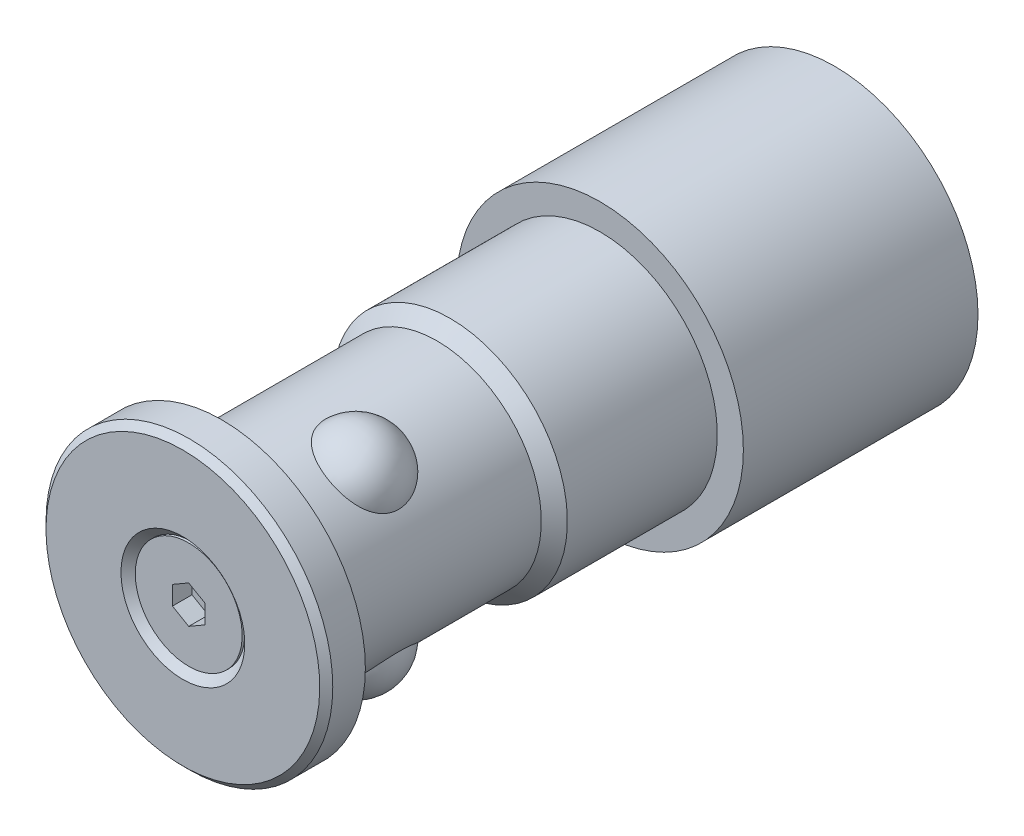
ISO-10303-21;
HEADER;
FILE_DESCRIPTION(('STEP AP214'),'2;1');
FILE_NAME('part.step','',(''),(''),'','','');
FILE_SCHEMA(('AUTOMOTIVE_DESIGN { 1 0 10303 214 1 1 1 1 }'));
ENDSEC;
DATA;
#1=APPLICATION_CONTEXT('core data for automotive mechanical design processes');
#2=APPLICATION_PROTOCOL_DEFINITION('international standard','automotive_design',2000,#1);
#3=PRODUCT_CONTEXT('',#1,'mechanical');
#4=PRODUCT('Part','Part','',(#3));
#5=PRODUCT_RELATED_PRODUCT_CATEGORY('part','',(#4));
#6=PRODUCT_DEFINITION_FORMATION('','',#4);
#7=PRODUCT_DEFINITION_CONTEXT('part definition',#1,'design');
#8=PRODUCT_DEFINITION('design','',#6,#7);
#9=PRODUCT_DEFINITION_SHAPE('','',#8);
#10=(LENGTH_UNIT() NAMED_UNIT(*) SI_UNIT(.MILLI.,.METRE.));
#11=(NAMED_UNIT(*) PLANE_ANGLE_UNIT() SI_UNIT($,.RADIAN.));
#12=(NAMED_UNIT(*) SI_UNIT($,.STERADIAN.) SOLID_ANGLE_UNIT());
#13=UNCERTAINTY_MEASURE_WITH_UNIT(LENGTH_MEASURE(1.E-05),#10,'distance_accuracy_value','');
#14=(GEOMETRIC_REPRESENTATION_CONTEXT(3) GLOBAL_UNCERTAINTY_ASSIGNED_CONTEXT((#13)) GLOBAL_UNIT_ASSIGNED_CONTEXT((#10,
#11,#12)) REPRESENTATION_CONTEXT('',''));
#15=CARTESIAN_POINT('',(0.,0.,0.));
#16=DIRECTION('',(0.,0.,1.));
#17=DIRECTION('',(1.,0.,0.));
#18=AXIS2_PLACEMENT_3D('',#15,#16,#17);
#19=CARTESIAN_POINT('',(0.,0.,-0.45));
#20=DIRECTION('',(0.,0.,1.));
#21=DIRECTION('',(-1.,0.,0.));
#22=AXIS2_PLACEMENT_3D('',#19,#20,#21);
#23=PLANE('',#22);
#24=DIRECTION('',(0.866025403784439,-0.5,0.));
#25=VECTOR('',#24,1.);
#26=CARTESIAN_POINT('',(-1.25,-0.721687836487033,-0.45));
#27=LINE('',#26,#25);
#28=CARTESIAN_POINT('',(-1.25,-0.721687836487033,-0.45));
#29=VERTEX_POINT('',#28);
#30=CARTESIAN_POINT('',(0.,-1.44337567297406,-0.45));
#31=VERTEX_POINT('',#30);
#32=EDGE_CURVE('E31',#29,#31,#27,.T.);
#33=ORIENTED_EDGE('',*,*,#32,.F.);
#34=DIRECTION('',(0.,-1.,0.));
#35=VECTOR('',#34,1.);
#36=CARTESIAN_POINT('',(-1.25,0.721687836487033,-0.45));
#37=LINE('',#36,#35);
#38=CARTESIAN_POINT('',(-1.25,0.721687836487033,-0.45));
#39=VERTEX_POINT('',#38);
#40=EDGE_CURVE('E115',#39,#29,#37,.T.);
#41=ORIENTED_EDGE('',*,*,#40,.F.);
#42=DIRECTION('',(-0.866025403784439,-0.5,0.));
#43=VECTOR('',#42,1.);
#44=CARTESIAN_POINT('',(0.,1.44337567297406,-0.45));
#45=LINE('',#44,#43);
#46=CARTESIAN_POINT('',(0.,1.44337567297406,-0.45));
#47=VERTEX_POINT('',#46);
#48=EDGE_CURVE('E113',#47,#39,#45,.T.);
#49=ORIENTED_EDGE('',*,*,#48,.F.);
#50=DIRECTION('',(-0.866025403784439,0.5,0.));
#51=VECTOR('',#50,1.);
#52=CARTESIAN_POINT('',(1.25,0.721687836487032,-0.45));
#53=LINE('',#52,#51);
#54=CARTESIAN_POINT('',(1.25,0.721687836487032,-0.45));
#55=VERTEX_POINT('',#54);
#56=EDGE_CURVE('E79',#55,#47,#53,.T.);
#57=ORIENTED_EDGE('',*,*,#56,.F.);
#58=DIRECTION('',(0.,1.,0.));
#59=VECTOR('',#58,1.);
#60=CARTESIAN_POINT('',(1.25,-0.721687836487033,-0.45));
#61=LINE('',#60,#59);
#62=CARTESIAN_POINT('',(1.25,-0.721687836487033,-0.45));
#63=VERTEX_POINT('',#62);
#64=EDGE_CURVE('E109',#63,#55,#61,.T.);
#65=ORIENTED_EDGE('',*,*,#64,.F.);
#66=DIRECTION('',(0.866025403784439,0.5,0.));
#67=VECTOR('',#66,1.);
#68=CARTESIAN_POINT('',(0.,-1.44337567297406,-0.45));
#69=LINE('',#68,#67);
#70=EDGE_CURVE('E105',#31,#63,#69,.T.);
#71=ORIENTED_EDGE('',*,*,#70,.F.);
#72=EDGE_LOOP('',(#33,#41,#49,#57,#65,#71));
#73=FACE_BOUND('',#72,.T.);
#74=CARTESIAN_POINT('',(0.,0.,-0.45));
#75=DIRECTION('',(0.,0.,1.));
#76=DIRECTION('',(-1.,0.,0.));
#77=AXIS2_PLACEMENT_3D('',#74,#75,#76);
#78=CIRCLE('',#77,4.1);
#79=CARTESIAN_POINT('',(-4.1,0.,-0.45));
#80=VERTEX_POINT('',#79);
#81=EDGE_CURVE('E9',#80,#80,#78,.T.);
#82=ORIENTED_EDGE('',*,*,#81,.T.);
#83=EDGE_LOOP('',(#82));
#84=FACE_BOUND('',#83,.T.);
#85=ADVANCED_FACE('F14',(#73,#84),#23,.T.);
#86=CARTESIAN_POINT('',(0.,0.,-0.45));
#87=DIRECTION('',(0.,0.,1.));
#88=DIRECTION('',(-1.,0.,0.));
#89=AXIS2_PLACEMENT_3D('',#86,#87,#88);
#90=CYLINDRICAL_SURFACE('',#89,4.1);
#91=CARTESIAN_POINT('',(0.,0.,-0.65));
#92=DIRECTION('',(0.,0.,1.));
#93=DIRECTION('',(-1.,0.,0.));
#94=AXIS2_PLACEMENT_3D('',#91,#92,#93);
#95=CIRCLE('',#94,4.1);
#96=CARTESIAN_POINT('',(-4.1,0.,-0.65));
#97=VERTEX_POINT('',#96);
#98=EDGE_CURVE('E23',#97,#97,#95,.T.);
#99=ORIENTED_EDGE('',*,*,#98,.T.);
#100=EDGE_LOOP('',(#99));
#101=FACE_BOUND('',#100,.T.);
#102=ORIENTED_EDGE('',*,*,#81,.F.);
#103=EDGE_LOOP('',(#102));
#104=FACE_BOUND('',#103,.T.);
#105=ADVANCED_FACE('F241',(#101,#104),#90,.T.);
#106=CARTESIAN_POINT('',(-1.25,-0.721687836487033,-1.95));
#107=DIRECTION('',(-0.5,-0.866025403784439,0.));
#108=DIRECTION('',(0.866025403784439,-0.5,0.));
#109=AXIS2_PLACEMENT_3D('',#106,#107,#108);
#110=PLANE('',#109);
#111=ORIENTED_EDGE('',*,*,#32,.T.);
#112=DIRECTION('',(0.,0.,1.));
#113=VECTOR('',#112,1.);
#114=CARTESIAN_POINT('',(0.,-1.44337567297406,-1.95));
#115=LINE('',#114,#113);
#116=CARTESIAN_POINT('',(0.,-1.44337567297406,-1.95));
#117=VERTEX_POINT('',#116);
#118=EDGE_CURVE('E61',#117,#31,#115,.T.);
#119=ORIENTED_EDGE('',*,*,#118,.F.);
#120=DIRECTION('',(0.866025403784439,-0.5,0.));
#121=VECTOR('',#120,1.);
#122=CARTESIAN_POINT('',(-1.25,-0.721687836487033,-1.95));
#123=LINE('',#122,#121);
#124=CARTESIAN_POINT('',(-1.25,-0.721687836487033,-1.95));
#125=VERTEX_POINT('',#124);
#126=EDGE_CURVE('E117',#125,#117,#123,.T.);
#127=ORIENTED_EDGE('',*,*,#126,.F.);
#128=DIRECTION('',(0.,0.,1.));
#129=VECTOR('',#128,1.);
#130=CARTESIAN_POINT('',(-1.25,-0.721687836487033,-1.95));
#131=LINE('',#130,#129);
#132=EDGE_CURVE('E39',#125,#29,#131,.T.);
#133=ORIENTED_EDGE('',*,*,#132,.T.);
#134=EDGE_LOOP('',(#111,#119,#127,#133));
#135=FACE_BOUND('',#134,.T.);
#136=ADVANCED_FACE('F248',(#135),#110,.F.);
#137=CARTESIAN_POINT('',(-1.25,0.721687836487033,-1.95));
#138=DIRECTION('',(-1.,0.,0.));
#139=DIRECTION('',(0.,-1.,0.));
#140=AXIS2_PLACEMENT_3D('',#137,#138,#139);
#141=PLANE('',#140);
#142=ORIENTED_EDGE('',*,*,#40,.T.);
#143=ORIENTED_EDGE('',*,*,#132,.F.);
#144=DIRECTION('',(0.,-1.,0.));
#145=VECTOR('',#144,1.);
#146=CARTESIAN_POINT('',(-1.25,0.721687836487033,-1.95));
#147=LINE('',#146,#145);
#148=CARTESIAN_POINT('',(-1.25,0.721687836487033,-1.95));
#149=VERTEX_POINT('',#148);
#150=EDGE_CURVE('E91',#149,#125,#147,.T.);
#151=ORIENTED_EDGE('',*,*,#150,.F.);
#152=DIRECTION('',(0.,0.,1.));
#153=VECTOR('',#152,1.);
#154=CARTESIAN_POINT('',(-1.25,0.721687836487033,-1.95));
#155=LINE('',#154,#153);
#156=EDGE_CURVE('E83',#149,#39,#155,.T.);
#157=ORIENTED_EDGE('',*,*,#156,.T.);
#158=EDGE_LOOP('',(#142,#143,#151,#157));
#159=FACE_BOUND('',#158,.T.);
#160=ADVANCED_FACE('F290',(#159),#141,.F.);
#161=CARTESIAN_POINT('',(0.,1.44337567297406,-1.95));
#162=DIRECTION('',(-0.5,0.866025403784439,0.));
#163=DIRECTION('',(-0.866025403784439,-0.5,0.));
#164=AXIS2_PLACEMENT_3D('',#161,#162,#163);
#165=PLANE('',#164);
#166=ORIENTED_EDGE('',*,*,#48,.T.);
#167=ORIENTED_EDGE('',*,*,#156,.F.);
#168=DIRECTION('',(-0.866025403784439,-0.5,0.));
#169=VECTOR('',#168,1.);
#170=CARTESIAN_POINT('',(0.,1.44337567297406,-1.95));
#171=LINE('',#170,#169);
#172=CARTESIAN_POINT('',(0.,1.44337567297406,-1.95));
#173=VERTEX_POINT('',#172);
#174=EDGE_CURVE('E87',#173,#149,#171,.T.);
#175=ORIENTED_EDGE('',*,*,#174,.F.);
#176=DIRECTION('',(0.,0.,1.));
#177=VECTOR('',#176,1.);
#178=CARTESIAN_POINT('',(0.,1.44337567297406,-1.95));
#179=LINE('',#178,#177);
#180=EDGE_CURVE('E72',#173,#47,#179,.T.);
#181=ORIENTED_EDGE('',*,*,#180,.T.);
#182=EDGE_LOOP('',(#166,#167,#175,#181));
#183=FACE_BOUND('',#182,.T.);
#184=ADVANCED_FACE('F88',(#183),#165,.F.);
#185=CARTESIAN_POINT('',(1.25,0.721687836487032,-1.95));
#186=DIRECTION('',(0.5,0.866025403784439,0.));
#187=DIRECTION('',(-0.866025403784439,0.5,0.));
#188=AXIS2_PLACEMENT_3D('',#185,#186,#187);
#189=PLANE('',#188);
#190=ORIENTED_EDGE('',*,*,#56,.T.);
#191=ORIENTED_EDGE('',*,*,#180,.F.);
#192=DIRECTION('',(-0.866025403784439,0.5,0.));
#193=VECTOR('',#192,1.);
#194=CARTESIAN_POINT('',(1.25,0.721687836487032,-1.95));
#195=LINE('',#194,#193);
#196=CARTESIAN_POINT('',(1.25,0.721687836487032,-1.95));
#197=VERTEX_POINT('',#196);
#198=EDGE_CURVE('E76',#197,#173,#195,.T.);
#199=ORIENTED_EDGE('',*,*,#198,.F.);
#200=DIRECTION('',(0.,0.,1.));
#201=VECTOR('',#200,1.);
#202=CARTESIAN_POINT('',(1.25,0.721687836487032,-1.95));
#203=LINE('',#202,#201);
#204=EDGE_CURVE('E84',#197,#55,#203,.T.);
#205=ORIENTED_EDGE('',*,*,#204,.T.);
#206=EDGE_LOOP('',(#190,#191,#199,#205));
#207=FACE_BOUND('',#206,.T.);
#208=ADVANCED_FACE('F74',(#207),#189,.F.);
#209=CARTESIAN_POINT('',(1.25,-0.721687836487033,-1.95));
#210=DIRECTION('',(1.,0.,0.));
#211=DIRECTION('',(0.,0.,1.));
#212=AXIS2_PLACEMENT_3D('',#209,#210,#211);
#213=PLANE('',#212);
#214=ORIENTED_EDGE('',*,*,#64,.T.);
#215=ORIENTED_EDGE('',*,*,#204,.F.);
#216=DIRECTION('',(0.,1.,0.));
#217=VECTOR('',#216,1.);
#218=CARTESIAN_POINT('',(1.25,-0.721687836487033,-1.95));
#219=LINE('',#218,#217);
#220=CARTESIAN_POINT('',(1.25,-0.721687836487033,-1.95));
#221=VERTEX_POINT('',#220);
#222=EDGE_CURVE('E97',#221,#197,#219,.T.);
#223=ORIENTED_EDGE('',*,*,#222,.F.);
#224=DIRECTION('',(0.,0.,1.));
#225=VECTOR('',#224,1.);
#226=CARTESIAN_POINT('',(1.25,-0.721687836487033,-1.95));
#227=LINE('',#226,#225);
#228=EDGE_CURVE('E121',#221,#63,#227,.T.);
#229=ORIENTED_EDGE('',*,*,#228,.T.);
#230=EDGE_LOOP('',(#214,#215,#223,#229));
#231=FACE_BOUND('',#230,.T.);
#232=ADVANCED_FACE('F286',(#231),#213,.F.);
#233=CARTESIAN_POINT('',(0.,-1.44337567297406,-1.95));
#234=DIRECTION('',(0.5,-0.866025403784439,0.));
#235=DIRECTION('',(0.866025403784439,0.5,0.));
#236=AXIS2_PLACEMENT_3D('',#233,#234,#235);
#237=PLANE('',#236);
#238=ORIENTED_EDGE('',*,*,#70,.T.);
#239=ORIENTED_EDGE('',*,*,#228,.F.);
#240=DIRECTION('',(0.866025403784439,0.5,0.));
#241=VECTOR('',#240,1.);
#242=CARTESIAN_POINT('',(0.,-1.44337567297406,-1.95));
#243=LINE('',#242,#241);
#244=EDGE_CURVE('E99',#117,#221,#243,.T.);
#245=ORIENTED_EDGE('',*,*,#244,.F.);
#246=ORIENTED_EDGE('',*,*,#118,.T.);
#247=EDGE_LOOP('',(#238,#239,#245,#246));
#248=FACE_BOUND('',#247,.T.);
#249=ADVANCED_FACE('F277',(#248),#237,.F.);
#250=CARTESIAN_POINT('',(0.,-1.44337567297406,-1.95));
#251=DIRECTION('',(0.,0.,1.));
#252=DIRECTION('',(-1.,0.,0.));
#253=AXIS2_PLACEMENT_3D('',#250,#251,#252);
#254=PLANE('',#253);
#255=ORIENTED_EDGE('',*,*,#126,.T.);
#256=ORIENTED_EDGE('',*,*,#244,.T.);
#257=ORIENTED_EDGE('',*,*,#222,.T.);
#258=ORIENTED_EDGE('',*,*,#198,.T.);
#259=ORIENTED_EDGE('',*,*,#174,.T.);
#260=ORIENTED_EDGE('',*,*,#150,.T.);
#261=EDGE_LOOP('',(#255,#256,#257,#258,#259,#260));
#262=FACE_BOUND('',#261,.T.);
#263=ADVANCED_FACE('F94',(#262),#254,.T.);
#264=CARTESIAN_POINT('',(-4.25,0.,-6.));
#265=DIRECTION('',(0.,0.,1.));
#266=DIRECTION('',(0.,1.,0.));
#267=AXIS2_PLACEMENT_3D('',#264,#265,#266);
#268=PLANE('',#267);
#269=CARTESIAN_POINT('',(0.,0.,-6.));
#270=DIRECTION('',(0.,0.,1.));
#271=DIRECTION('',(0.,1.,0.));
#272=AXIS2_PLACEMENT_3D('',#269,#270,#271);
#273=CIRCLE('',#272,4.25);
#274=CARTESIAN_POINT('',(0.,4.25,-6.));
#275=VERTEX_POINT('',#274);
#276=EDGE_CURVE('E539',#275,#275,#273,.T.);
#277=ORIENTED_EDGE('',*,*,#276,.F.);
#278=EDGE_LOOP('',(#277));
#279=FACE_BOUND('',#278,.T.);
#280=ADVANCED_FACE('F169',(#279),#268,.F.);
#281=CARTESIAN_POINT('',(-6.32929196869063,0.,-10.1));
#282=DIRECTION('',(0.,0.,1.));
#283=DIRECTION('',(1.,0.,0.));
#284=AXIS2_PLACEMENT_3D('',#281,#282,#283);
#285=SPHERICAL_SURFACE('',#284,3.3734);
#286=CARTESIAN_POINT('',(-3.69256225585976,2.10415873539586,-10.1));
#287=CARTESIAN_POINT('',(-3.69256936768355,2.10415953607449,-9.93337658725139));
#288=CARTESIAN_POINT('',(-3.69920900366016,2.09262459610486,-9.76653592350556));
#289=CARTESIAN_POINT('',(-3.72515079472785,2.04608069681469,-9.43680628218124));
#290=CARTESIAN_POINT('',(-3.74448545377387,2.01101147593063,-9.27392856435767));
#291=CARTESIAN_POINT('',(-3.79386104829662,1.91624355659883,-8.956516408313));
#292=CARTESIAN_POINT('',(-3.82393673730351,1.85646480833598,-8.80201095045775));
#293=CARTESIAN_POINT('',(-3.89119827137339,1.71098412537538,-8.50749923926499));
#294=CARTESIAN_POINT('',(-3.92837050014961,1.62533165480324,-8.36746599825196));
#295=CARTESIAN_POINT('',(-3.99405552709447,1.45461079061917,-8.14415036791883));
#296=CARTESIAN_POINT('',(-4.02212956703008,1.37589454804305,-8.0558669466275));
#297=CARTESIAN_POINT('',(-4.07670198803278,1.2045952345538,-7.89336358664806));
#298=CARTESIAN_POINT('',(-4.10320235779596,1.11203020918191,-7.81912562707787));
#299=CARTESIAN_POINT('',(-4.14795537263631,0.929697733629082,-7.69839573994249));
#300=CARTESIAN_POINT('',(-4.16684972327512,0.841764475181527,-7.6493789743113));
#301=CARTESIAN_POINT('',(-4.19972985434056,0.658350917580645,-7.5658780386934));
#302=CARTESIAN_POINT('',(-4.21371773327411,0.562873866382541,-7.53138765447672));
#303=CARTESIAN_POINT('',(-4.23534619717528,0.366275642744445,-7.47862843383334));
#304=CARTESIAN_POINT('',(-4.24295460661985,0.265128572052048,-7.46044179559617));
#305=CARTESIAN_POINT('',(-4.25078922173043,0.0609324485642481,-7.44171889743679));
#306=CARTESIAN_POINT('',(-4.25101794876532,-0.0421159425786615,-7.4411766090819));
#307=CARTESIAN_POINT('',(-4.24438783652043,-0.237450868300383,-7.4570142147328));
#308=CARTESIAN_POINT('',(-4.23815260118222,-0.329884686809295,-7.47190517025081));
#309=CARTESIAN_POINT('',(-4.22016945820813,-0.510822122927,-7.51557888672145));
#310=CARTESIAN_POINT('',(-4.20842133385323,-0.59932558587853,-7.54436219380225));
#311=CARTESIAN_POINT('',(-4.18014986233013,-0.772490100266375,-7.61535721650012));
#312=CARTESIAN_POINT('',(-4.16351703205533,-0.857004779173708,-7.65787934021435));
#313=CARTESIAN_POINT('',(-4.12701129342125,-1.01839920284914,-7.75440091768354));
#314=CARTESIAN_POINT('',(-4.10713717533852,-1.09527607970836,-7.80840465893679));
#315=CARTESIAN_POINT('',(-4.06276521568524,-1.25052934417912,-7.93419533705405));
#316=CARTESIAN_POINT('',(-4.03800664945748,-1.32767526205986,-8.00740389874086));
#317=CARTESIAN_POINT('',(-3.98816343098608,-1.47064456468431,-8.16401592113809));
#318=CARTESIAN_POINT('',(-3.96307859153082,-1.53646110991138,-8.24742548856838));
#319=CARTESIAN_POINT('',(-3.9095206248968,-1.66858920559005,-8.43949019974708));
#320=CARTESIAN_POINT('',(-3.88134414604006,-1.73248078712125,-8.54989256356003));
#321=CARTESIAN_POINT('',(-3.82931183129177,-1.84463877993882,-8.77930009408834));
#322=CARTESIAN_POINT('',(-3.80545889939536,-1.89289470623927,-8.8983109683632));
#323=CARTESIAN_POINT('',(-3.75993630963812,-1.98200893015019,-9.16523259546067));
#324=CARTESIAN_POINT('',(-3.73950882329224,-2.01979689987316,-9.3143862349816));
#325=CARTESIAN_POINT('',(-3.70913925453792,-2.0750342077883,-9.61745099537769));
#326=CARTESIAN_POINT('',(-3.69920230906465,-2.0924735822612,-9.77136440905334));
#327=CARTESIAN_POINT('',(-3.69023897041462,-2.10826031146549,-10.0976234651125));
#328=CARTESIAN_POINT('',(-3.69254139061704,-2.10428179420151,-10.2701243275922));
#329=CARTESIAN_POINT('',(-3.71096996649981,-2.07160368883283,-10.6121533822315));
#330=CARTESIAN_POINT('',(-3.72710622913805,-2.04288602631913,-10.7816793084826));
#331=CARTESIAN_POINT('',(-3.7718277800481,-1.95911220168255,-11.1157726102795));
#332=CARTESIAN_POINT('',(-3.80063313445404,-1.90358866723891,-11.2801946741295));
#333=CARTESIAN_POINT('',(-3.86713156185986,-1.76456953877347,-11.5948098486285));
#334=CARTESIAN_POINT('',(-3.90481098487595,-1.68111682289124,-11.7450243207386));
#335=CARTESIAN_POINT('',(-3.97209725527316,-1.51345338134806,-11.9837322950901));
#336=CARTESIAN_POINT('',(-4.00089260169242,-1.43642266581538,-12.0775217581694));
#337=CARTESIAN_POINT('',(-4.05751756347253,-1.26765308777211,-12.2511203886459));
#338=CARTESIAN_POINT('',(-4.08534851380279,-1.17593563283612,-12.3309495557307));
#339=CARTESIAN_POINT('',(-4.13278161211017,-0.994921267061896,-12.4613776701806));
#340=CARTESIAN_POINT('',(-4.15298474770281,-0.907694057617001,-12.5146232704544));
#341=CARTESIAN_POINT('',(-4.18874327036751,-0.724964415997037,-12.6066053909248));
#342=CARTESIAN_POINT('',(-4.20430052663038,-0.6294653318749,-12.6453477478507));
#343=CARTESIAN_POINT('',(-4.22917097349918,-0.43192931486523,-12.7064652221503));
#344=CARTESIAN_POINT('',(-4.23844848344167,-0.329858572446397,-12.7287468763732));
#345=CARTESIAN_POINT('',(-4.24947948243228,-0.122997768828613,-12.7551778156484));
#346=CARTESIAN_POINT('',(-4.25123641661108,-0.0182089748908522,-12.7593354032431));
#347=CARTESIAN_POINT('',(-4.24723078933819,0.179938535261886,-12.7497781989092));
#348=CARTESIAN_POINT('',(-4.24219567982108,0.273401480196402,-12.7377925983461));
#349=CARTESIAN_POINT('',(-4.22637906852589,0.456832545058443,-12.6995627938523));
#350=CARTESIAN_POINT('',(-4.21559759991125,0.546800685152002,-12.6733186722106));
#351=CARTESIAN_POINT('',(-4.18917010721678,0.722010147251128,-12.6074763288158));
#352=CARTESIAN_POINT('',(-4.173473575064,0.807191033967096,-12.5677390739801));
#353=CARTESIAN_POINT('',(-4.13860424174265,0.970268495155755,-12.4766218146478));
#354=CARTESIAN_POINT('',(-4.11943019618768,1.04816244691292,-12.425237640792));
#355=CARTESIAN_POINT('',(-4.0764495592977,1.20520215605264,-12.3053335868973));
#356=CARTESIAN_POINT('',(-4.05236408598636,1.28323630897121,-12.2354631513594));
#357=CARTESIAN_POINT('',(-4.00351639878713,1.42836646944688,-12.0854155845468));
#358=CARTESIAN_POINT('',(-3.97875385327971,1.49545700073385,-12.0052333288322));
#359=CARTESIAN_POINT('',(-3.9255747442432,1.6305237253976,-11.8203743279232));
#360=CARTESIAN_POINT('',(-3.89737050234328,1.69619229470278,-11.7139516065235));
#361=CARTESIAN_POINT('',(-3.84471107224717,1.81239330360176,-11.4922323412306));
#362=CARTESIAN_POINT('',(-3.82026004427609,1.86290900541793,-11.3769261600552));
#363=CARTESIAN_POINT('',(-3.77272763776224,1.95764493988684,-11.117199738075));
#364=CARTESIAN_POINT('',(-3.75081256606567,1.99878952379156,-10.9714430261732));
#365=CARTESIAN_POINT('',(-3.71692901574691,2.06111634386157,-10.6748039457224));
#366=CARTESIAN_POINT('',(-3.70494648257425,2.08232679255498,-10.523929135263));
#367=CARTESIAN_POINT('',(-3.69646868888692,2.09728957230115,-10.326973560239));
#368=CARTESIAN_POINT('',(-3.69500580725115,2.09986594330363,-10.2816311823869));
#369=CARTESIAN_POINT('',(-3.69305165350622,2.10330035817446,-10.1908645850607));
#370=CARTESIAN_POINT('',(-3.69256031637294,2.10415851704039,-10.1454403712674));
#371=CARTESIAN_POINT('',(-3.69256225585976,2.10415873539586,-10.1));
#372=B_SPLINE_CURVE_WITH_KNOTS('',3,(#286,#287,#288,#289,#290,#291,#292,#293,#294,#295,#296,
#297,#298,#299,#300,#301,#302,#303,#304,#305,#306,#307,#308,#309,#310,#311,#312,#313,#314,#315,
#316,#317,#318,#319,#320,#321,#322,#323,#324,#325,#326,#327,#328,#329,#330,#331,#332,#333,#334,
#335,#336,#337,#338,#339,#340,#341,#342,#343,#344,#345,#346,#347,#348,#349,#350,#351,#352,#353,
#354,#355,#356,#357,#358,#359,#360,#361,#362,#363,#364,#365,#366,#367,#368,#369,#370,#371),
.UNSPECIFIED.,.T.,.F.,(4,2,2,2,2,2,2,2,2,2,2,2,2,2,2,2,2,2,2,2,2,2,2,2,2,2,2,2,2,2,2,2,2,2,2,2,
2,2,2,2,2,2,4),(0.,0.499714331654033,1.00071313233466,1.50334786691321,2.00502770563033,
2.36836543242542,2.73123377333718,3.03724552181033,3.3431262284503,3.65054055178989,
3.95784984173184,4.23804311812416,4.51824741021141,4.80528615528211,5.09243227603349,
5.41881454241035,5.74539315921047,6.13583364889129,6.52653542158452,6.99029089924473,
7.45427336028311,7.96959188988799,8.48528723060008,9.010317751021,9.53454589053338,
9.90736959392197,10.2796547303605,10.5908872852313,10.9019944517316,11.214854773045,
11.5275717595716,11.8093192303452,12.0910650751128,12.3758068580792,12.6606507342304,
12.9818878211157,13.3032851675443,13.6864482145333,14.0700329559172,14.5273362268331,
14.9839913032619,15.1202790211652,15.2565576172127),.UNSPECIFIED.);
#373=CARTESIAN_POINT('',(-3.69256225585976,2.10415873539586,-10.1));
#374=VERTEX_POINT('',#373);
#375=EDGE_CURVE('E175',#374,#374,#372,.T.);
#376=ORIENTED_EDGE('',*,*,#375,.T.);
#377=EDGE_LOOP('',(#376));
#378=FACE_BOUND('',#377,.T.);
#379=ADVANCED_FACE('F200',(#378),#285,.T.);
#380=CARTESIAN_POINT('',(3.16464598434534,-5.4813276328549,-10.1));
#381=DIRECTION('',(0.,0.,1.));
#382=DIRECTION('',(-0.5,0.866025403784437,0.));
#383=AXIS2_PLACEMENT_3D('',#380,#381,#382);
#384=SPHERICAL_SURFACE('',#383,3.3734);
#385=CARTESIAN_POINT('',(3.66853604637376,-2.14577335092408,-10.1));
#386=CARTESIAN_POINT('',(3.66854029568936,-2.14577910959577,-10.2666234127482));
#387=CARTESIAN_POINT('',(3.66187056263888,-2.15729667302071,-10.4334640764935));
#388=CARTESIAN_POINT('',(3.63453325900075,-2.20303487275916,-10.7631937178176));
#389=CARTESIAN_POINT('',(3.61382975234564,-2.23731378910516,-10.9260714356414));
#390=CARTESIAN_POINT('',(3.5564461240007,-2.32745826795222,-11.2434835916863));
#391=CARTESIAN_POINT('',(3.51971405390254,-2.38339395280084,-11.3979890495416));
#392=CARTESIAN_POINT('',(3.42735485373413,-2.51438449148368,-11.6925007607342));
#393=CARTESIAN_POINT('',(3.37176375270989,-2.58940282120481,-11.832534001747));
#394=CARTESIAN_POINT('',(3.25675766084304,-2.73164815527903,-12.05584963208));
#395=CARTESIAN_POINT('',(3.20262441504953,-2.7953191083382,-12.1441330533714));
#396=CARTESIAN_POINT('',(3.08156106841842,-2.92822986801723,-12.3066364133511));
#397=CARTESIAN_POINT('',(3.014647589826,-2.99746237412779,-12.3808743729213));
#398=CARTESIAN_POINT('',(2.87911954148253,-3.12738585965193,-12.5016042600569));
#399=CARTESIAN_POINT('',(2.81241428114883,-3.18771547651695,-12.5506210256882));
#400=CARTESIAN_POINT('',(2.67001354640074,-3.30789728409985,-12.6341219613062));
#401=CARTESIAN_POINT('',(2.59432193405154,-3.36774966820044,-12.6686123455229));
#402=CARTESIAN_POINT('',(2.43487710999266,-3.48477957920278,-12.7213715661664));
#403=CARTESIAN_POINT('',(2.35108538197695,-3.5419421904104,-12.7395582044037));
#404=CARTESIAN_POINT('',(2.17816365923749,-3.65082522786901,-12.7582811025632));
#405=CARTESIAN_POINT('',(2.08903549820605,-3.70254750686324,-12.7588233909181));
#406=CARTESIAN_POINT('',(1.91655543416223,-3.79447312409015,-12.7429857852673));
#407=CARTESIAN_POINT('',(1.8333877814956,-3.83529016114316,-12.7280948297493));
#408=CARTESIAN_POINT('',(1.66769979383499,-3.91018502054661,-12.6844211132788));
#409=CARTESIAN_POINT('',(1.5851794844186,-3.94426257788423,-12.655637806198));
#410=CARTESIAN_POINT('',(1.42107888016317,-4.00636102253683,-12.5846427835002));
#411=CARTESIAN_POINT('',(1.33957060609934,-4.03421390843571,-12.5421206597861));
#412=CARTESIAN_POINT('',(1.18154606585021,-4.08329622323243,-12.445599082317));
#413=CARTESIAN_POINT('',(1.10503167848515,-4.10452317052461,-12.3915953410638));
#414=CARTESIAN_POINT('',(0.948392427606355,-4.14372255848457,-12.2658046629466));
#415=CARTESIAN_POINT('',(0.86920281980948,-4.16085397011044,-12.1925961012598));
#416=CARTESIAN_POINT('',(0.72046616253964,-4.18917312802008,-12.0359840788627));
#417=CARTESIAN_POINT('',(0.650924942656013,-4.20035729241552,-11.9525745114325));
#418=CARTESIAN_POINT('',(0.509719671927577,-4.22003878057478,-11.7605098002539));
#419=CARTESIAN_POINT('',(0.440299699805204,-4.22758302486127,-11.650107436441));
#420=CARTESIAN_POINT('',(0.317151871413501,-4.23860071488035,-11.4206999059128));
#421=CARTESIAN_POINT('',(0.263434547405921,-4.24207143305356,-11.301689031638));
#422=CARTESIAN_POINT('',(0.163498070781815,-4.2472048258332,-11.0347674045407));
#423=CARTESIAN_POINT('',(0.120558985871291,-4.24840808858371,-10.8856137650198));
#424=CARTESIAN_POINT('',(0.0575372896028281,-4.24972592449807,-10.5825490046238));
#425=CARTESIAN_POINT('',(0.0374658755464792,-4.24983996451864,-10.4286355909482));
#426=CARTESIAN_POINT('',(0.0193124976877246,-4.24997085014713,-10.1023765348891));
#427=CARTESIAN_POINT('',(0.0239092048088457,-4.24997554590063,-9.92987567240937));
#428=CARTESIAN_POINT('',(0.0614235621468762,-4.24959610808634,-9.58784661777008));
#429=CARTESIAN_POINT('',(0.0943619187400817,-4.24921169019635,-9.41832069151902));
#430=CARTESIAN_POINT('',(0.189272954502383,-4.24605477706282,-9.08422738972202));
#431=CARTESIAN_POINT('',(0.251760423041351,-4.24323917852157,-8.91980532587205));
#432=CARTESIAN_POINT('',(0.405403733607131,-4.23131894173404,-8.60519015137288));
#433=CARTESIAN_POINT('',(0.496515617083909,-4.22222392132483,-8.45497567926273));
#434=CARTESIAN_POINT('',(0.675359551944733,-4.19666382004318,-8.21626770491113));
#435=CARTESIAN_POINT('',(0.756467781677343,-4.18308596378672,-8.12247824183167));
#436=CARTESIAN_POINT('',(0.930939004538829,-4.14773983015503,-7.94887961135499));
#437=CARTESIAN_POINT('',(1.02428412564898,-4.12598341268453,-7.8690504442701));
#438=CARTESIAN_POINT('',(1.20476371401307,-4.07655449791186,-7.73862232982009));
#439=CARTESIAN_POINT('',(1.2904062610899,-4.05043732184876,-7.68537672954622));
#440=CARTESIAN_POINT('',(1.46653403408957,-3.99004029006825,-7.59339460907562));
#441=CARTESIAN_POINT('',(1.55701729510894,-3.95576372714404,-7.55465225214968));
#442=CARTESIAN_POINT('',(1.74052372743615,-3.87853415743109,-7.49353477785));
#443=CARTESIAN_POINT('',(1.83355833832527,-3.83553334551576,-7.471253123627));
#444=CARTESIAN_POINT('',(2.0182205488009,-3.74165606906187,-7.44482218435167));
#445=CARTESIAN_POINT('',(2.10984877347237,-3.69078322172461,-7.44066459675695));
#446=CARTESIAN_POINT('',(2.27944673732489,-3.58824049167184,-7.45022180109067));
#447=CARTESIAN_POINT('',(2.35787046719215,-3.53714848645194,-7.4622074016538));
#448=CARTESIAN_POINT('',(2.50881812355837,-3.43173536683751,-7.50043720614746));
#449=CARTESIAN_POINT('',(2.58134208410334,-3.37741427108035,-7.52668132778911));
#450=CARTESIAN_POINT('',(2.7198641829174,-3.26692265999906,-7.5925236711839));
#451=CARTESIAN_POINT('',(2.78578472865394,-3.21073862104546,-7.63226092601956));
#452=CARTESIAN_POINT('',(2.90957928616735,-3.09900216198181,-7.72337818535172));
#453=CARTESIAN_POINT('',(2.96745040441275,-3.04344997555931,-7.77476235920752));
#454=CARTESIAN_POINT('',(3.0819604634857,-2.92770779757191,-7.89466641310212));
#455=CARTESIAN_POINT('',(3.13749728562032,-2.86783208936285,-7.96453684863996));
#456=CARTESIAN_POINT('',(3.23875984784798,-2.75296367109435,-8.11458441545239));
#457=CARTESIAN_POINT('',(3.28448067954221,-2.69797341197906,-8.19476667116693));
#458=CARTESIAN_POINT('',(3.37486233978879,-2.5843855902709,-8.3796256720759));
#459=CARTESIAN_POINT('',(3.41763086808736,-2.52712571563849,-8.48604839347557));
#460=CARTESIAN_POINT('',(3.49193417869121,-2.42342080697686,-8.70776765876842));
#461=CARTESIAN_POINT('',(3.52345654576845,-2.37698774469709,-8.82307383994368));
#462=CARTESIAN_POINT('',(3.58173406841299,-2.28845550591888,-9.08280026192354));
#463=CARTESIAN_POINT('',(3.60640878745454,-2.24890420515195,-9.22855697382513));
#464=CARTESIAN_POINT('',(3.64344362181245,-2.18839677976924,-9.52519605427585));
#465=CARTESIAN_POINT('',(3.6558211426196,-2.1674143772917,-9.6760708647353));
#466=CARTESIAN_POINT('',(3.66454039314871,-2.15259100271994,-9.87302643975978));
#467=CARTESIAN_POINT('',(3.66604015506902,-2.1500359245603,-9.91836881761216));
#468=CARTESIAN_POINT('',(3.66803736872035,-2.14662637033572,-10.0091354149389));
#469=CARTESIAN_POINT('',(3.66853488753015,-2.14577178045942,-10.0545596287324));
#470=CARTESIAN_POINT('',(3.66853604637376,-2.14577335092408,-10.1));
#471=B_SPLINE_CURVE_WITH_KNOTS('',3,(#385,#386,#387,#388,#389,#390,#391,#392,#393,#394,#395,
#396,#397,#398,#399,#400,#401,#402,#403,#404,#405,#406,#407,#408,#409,#410,#411,#412,#413,#414,
#415,#416,#417,#418,#419,#420,#421,#422,#423,#424,#425,#426,#427,#428,#429,#430,#431,#432,#433,
#434,#435,#436,#437,#438,#439,#440,#441,#442,#443,#444,#445,#446,#447,#448,#449,#450,#451,#452,
#453,#454,#455,#456,#457,#458,#459,#460,#461,#462,#463,#464,#465,#466,#467,#468,#469,#470),
.UNSPECIFIED.,.T.,.F.,(4,2,2,2,2,2,2,2,2,2,2,2,2,2,2,2,2,2,2,2,2,2,2,2,2,2,2,2,2,2,2,2,2,2,2,2,
2,2,2,2,2,2,4),(0.,0.49971433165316,1.00071313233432,1.50334786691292,2.0050277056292,
2.36836543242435,2.73123377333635,3.0372455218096,3.34312622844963,3.65054055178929,
3.95784984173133,4.23804311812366,4.51824741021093,4.8052861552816,5.09243227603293,
5.41881454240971,5.74539315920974,6.13583364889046,6.52653542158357,6.99029089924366,
7.45427336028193,7.96959188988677,8.48528723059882,9.01031775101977,9.53454589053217,
9.90736959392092,10.2796547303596,10.5908872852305,10.9019944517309,11.2148547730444,
11.5275717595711,11.8093192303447,12.0910650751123,12.3758068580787,12.6606507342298,
12.9818878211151,13.3032851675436,13.6864482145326,14.0700329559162,14.5273362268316,
14.9839913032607,15.120279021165,15.2565576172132),.UNSPECIFIED.);
#472=CARTESIAN_POINT('',(3.66853604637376,-2.14577335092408,-10.1));
#473=VERTEX_POINT('',#472);
#474=EDGE_CURVE('E149',#473,#473,#471,.T.);
#475=ORIENTED_EDGE('',*,*,#474,.T.);
#476=EDGE_LOOP('',(#475));
#477=FACE_BOUND('',#476,.T.);
#478=ADVANCED_FACE('F167',(#477),#384,.T.);
#479=CARTESIAN_POINT('',(3.16464598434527,5.48132763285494,-10.1));
#480=DIRECTION('',(0.,0.,1.));
#481=DIRECTION('',(-0.499999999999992,-0.866025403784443,0.));
#482=AXIS2_PLACEMENT_3D('',#479,#480,#481);
#483=SPHERICAL_SURFACE('',#482,3.3734);
#484=CARTESIAN_POINT('',(3.66853604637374,2.14577335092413,-10.1));
#485=CARTESIAN_POINT('',(3.66854029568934,2.14577910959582,-9.93337658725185));
#486=CARTESIAN_POINT('',(3.66187056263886,2.15729667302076,-9.76653592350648));
#487=CARTESIAN_POINT('',(3.63453325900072,2.2030348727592,-9.43680628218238));
#488=CARTESIAN_POINT('',(3.61382975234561,2.23731378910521,-9.27392856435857));
#489=CARTESIAN_POINT('',(3.55644612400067,2.32745826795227,-8.95651640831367));
#490=CARTESIAN_POINT('',(3.51971405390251,2.38339395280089,-8.80201095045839));
#491=CARTESIAN_POINT('',(3.4273548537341,2.51438449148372,-8.50749923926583));
#492=CARTESIAN_POINT('',(3.37176375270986,2.58940282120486,-8.36746599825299));
#493=CARTESIAN_POINT('',(3.25675766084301,2.73164815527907,-8.14415036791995));
#494=CARTESIAN_POINT('',(3.20262441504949,2.79531910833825,-8.05586694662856));
#495=CARTESIAN_POINT('',(3.08156106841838,2.92822986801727,-7.89336358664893));
#496=CARTESIAN_POINT('',(3.01464758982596,2.99746237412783,-7.81912562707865));
#497=CARTESIAN_POINT('',(2.87911954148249,3.12738585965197,-7.69839573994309));
#498=CARTESIAN_POINT('',(2.81241428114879,3.18771547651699,-7.64937897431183));
#499=CARTESIAN_POINT('',(2.67001354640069,3.30789728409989,-7.5658780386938));
#500=CARTESIAN_POINT('',(2.5943219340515,3.36774966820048,-7.53138765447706));
#501=CARTESIAN_POINT('',(2.43487710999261,3.48477957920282,-7.47862843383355));
#502=CARTESIAN_POINT('',(2.3510853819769,3.54194219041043,-7.46044179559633));
#503=CARTESIAN_POINT('',(2.17816365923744,3.65082522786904,-7.44171889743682));
#504=CARTESIAN_POINT('',(2.089035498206,3.70254750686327,-7.44117660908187));
#505=CARTESIAN_POINT('',(1.91655543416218,3.79447312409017,-7.45701421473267));
#506=CARTESIAN_POINT('',(1.83338778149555,3.83529016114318,-7.47190517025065));
#507=CARTESIAN_POINT('',(1.66769979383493,3.91018502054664,-7.5155788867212));
#508=CARTESIAN_POINT('',(1.58517948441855,3.94426257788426,-7.54436219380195));
#509=CARTESIAN_POINT('',(1.42107888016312,4.00636102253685,-7.61535721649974));
#510=CARTESIAN_POINT('',(1.33957060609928,4.03421390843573,-7.65787934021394));
#511=CARTESIAN_POINT('',(1.18154606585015,4.08329622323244,-7.75440091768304));
#512=CARTESIAN_POINT('',(1.10503167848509,4.10452317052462,-7.80840465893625));
#513=CARTESIAN_POINT('',(0.948392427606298,4.14372255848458,-7.93419533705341));
#514=CARTESIAN_POINT('',(0.86920281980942,4.16085397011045,-8.00740389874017));
#515=CARTESIAN_POINT('',(0.72046616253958,4.18917312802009,-8.1640159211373));
#516=CARTESIAN_POINT('',(0.650924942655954,4.20035729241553,-8.24742548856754));
#517=CARTESIAN_POINT('',(0.509719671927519,4.22003878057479,-8.43949019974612));
#518=CARTESIAN_POINT('',(0.440299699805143,4.22758302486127,-8.54989256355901));
#519=CARTESIAN_POINT('',(0.317151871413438,4.23860071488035,-8.7793000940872));
#520=CARTESIAN_POINT('',(0.263434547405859,4.24207143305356,-8.898310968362));
#521=CARTESIAN_POINT('',(0.163498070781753,4.24720482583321,-9.16523259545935));
#522=CARTESIAN_POINT('',(0.12055898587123,4.24840808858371,-9.31438623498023));
#523=CARTESIAN_POINT('',(0.0575372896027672,4.24972592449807,-9.61745099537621));
#524=CARTESIAN_POINT('',(0.0374658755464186,4.24983996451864,-9.77136440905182));
#525=CARTESIAN_POINT('',(0.019312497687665,4.24997085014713,-10.0976234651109));
#526=CARTESIAN_POINT('',(0.0239092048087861,4.24997554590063,-10.2701243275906));
#527=CARTESIAN_POINT('',(0.0614235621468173,4.24959610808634,-10.6121533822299));
#528=CARTESIAN_POINT('',(0.0943619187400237,4.24921169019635,-10.781679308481));
#529=CARTESIAN_POINT('',(0.189272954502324,4.24605477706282,-11.115772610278));
#530=CARTESIAN_POINT('',(0.251760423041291,4.24323917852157,-11.2801946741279));
#531=CARTESIAN_POINT('',(0.40540373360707,4.23131894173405,-11.5948098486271));
#532=CARTESIAN_POINT('',(0.496515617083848,4.22222392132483,-11.7450243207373));
#533=CARTESIAN_POINT('',(0.675359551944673,4.19666382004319,-11.9837322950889));
#534=CARTESIAN_POINT('',(0.756467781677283,4.18308596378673,-12.0775217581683));
#535=CARTESIAN_POINT('',(0.930939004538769,4.14773983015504,-12.251120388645));
#536=CARTESIAN_POINT('',(1.02428412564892,4.12598341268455,-12.3309495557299));
#537=CARTESIAN_POINT('',(1.20476371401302,4.07655449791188,-12.4613776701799));
#538=CARTESIAN_POINT('',(1.29040626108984,4.05043732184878,-12.5146232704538));
#539=CARTESIAN_POINT('',(1.46653403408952,3.99004029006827,-12.6066053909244));
#540=CARTESIAN_POINT('',(1.55701729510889,3.95576372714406,-12.6453477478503));
#541=CARTESIAN_POINT('',(1.7405237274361,3.87853415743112,-12.70646522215));
#542=CARTESIAN_POINT('',(1.83355833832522,3.83553334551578,-12.728746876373));
#543=CARTESIAN_POINT('',(2.01822054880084,3.7416560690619,-12.7551778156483));
#544=CARTESIAN_POINT('',(2.10984877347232,3.69078322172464,-12.759335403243));
#545=CARTESIAN_POINT('',(2.27944673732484,3.58824049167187,-12.7497781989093));
#546=CARTESIAN_POINT('',(2.35787046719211,3.53714848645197,-12.7377925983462));
#547=CARTESIAN_POINT('',(2.50881812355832,3.43173536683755,-12.6995627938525));
#548=CARTESIAN_POINT('',(2.58134208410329,3.37741427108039,-12.6733186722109));
#549=CARTESIAN_POINT('',(2.71986418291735,3.26692265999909,-12.6074763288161));
#550=CARTESIAN_POINT('',(2.7857847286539,3.21073862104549,-12.5677390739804));
#551=CARTESIAN_POINT('',(2.90957928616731,3.09900216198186,-12.4766218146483));
#552=CARTESIAN_POINT('',(2.9674504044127,3.04344997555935,-12.4252376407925));
#553=CARTESIAN_POINT('',(3.08196046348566,2.92770779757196,-12.3053335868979));
#554=CARTESIAN_POINT('',(3.13749728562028,2.86783208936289,-12.23546315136));
#555=CARTESIAN_POINT('',(3.23875984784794,2.7529636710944,-12.0854155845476));
#556=CARTESIAN_POINT('',(3.28448067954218,2.6979734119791,-12.0052333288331));
#557=CARTESIAN_POINT('',(3.37486233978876,2.58438559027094,-11.8203743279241));
#558=CARTESIAN_POINT('',(3.41763086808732,2.52712571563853,-11.7139516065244));
#559=CARTESIAN_POINT('',(3.49193417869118,2.4234208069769,-11.4922323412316));
#560=CARTESIAN_POINT('',(3.52345654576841,2.37698774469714,-11.3769261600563));
#561=CARTESIAN_POINT('',(3.58173406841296,2.28845550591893,-11.1171997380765));
#562=CARTESIAN_POINT('',(3.60640878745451,2.24890420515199,-10.9714430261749));
#563=CARTESIAN_POINT('',(3.64344362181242,2.18839677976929,-10.6748039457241));
#564=CARTESIAN_POINT('',(3.65582114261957,2.16741437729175,-10.5239291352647));
#565=CARTESIAN_POINT('',(3.66454039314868,2.15259100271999,-10.3269735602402));
#566=CARTESIAN_POINT('',(3.66604015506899,2.15003592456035,-10.2816311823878));
#567=CARTESIAN_POINT('',(3.66803736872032,2.14662637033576,-10.1908645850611));
#568=CARTESIAN_POINT('',(3.66853488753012,2.14577178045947,-10.1454403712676));
#569=CARTESIAN_POINT('',(3.66853604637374,2.14577335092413,-10.1));
#570=B_SPLINE_CURVE_WITH_KNOTS('',3,(#484,#485,#486,#487,#488,#489,#490,#491,#492,#493,#494,
#495,#496,#497,#498,#499,#500,#501,#502,#503,#504,#505,#506,#507,#508,#509,#510,#511,#512,#513,
#514,#515,#516,#517,#518,#519,#520,#521,#522,#523,#524,#525,#526,#527,#528,#529,#530,#531,#532,
#533,#534,#535,#536,#537,#538,#539,#540,#541,#542,#543,#544,#545,#546,#547,#548,#549,#550,#551,
#552,#553,#554,#555,#556,#557,#558,#559,#560,#561,#562,#563,#564,#565,#566,#567,#568,#569),
.UNSPECIFIED.,.T.,.F.,(4,2,2,2,2,2,2,2,2,2,2,2,2,2,2,2,2,2,2,2,2,2,2,2,2,2,2,2,2,2,2,2,2,2,2,2,
2,2,2,2,2,2,4),(0.,0.49971433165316,1.00071313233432,1.50334786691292,2.0050277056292,
2.36836543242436,2.73123377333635,3.0372455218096,3.34312622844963,3.6505405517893,
3.95784984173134,4.23804311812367,4.51824741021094,4.80528615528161,5.09243227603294,
5.41881454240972,5.74539315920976,6.13583364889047,6.52653542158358,6.99029089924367,
7.45427336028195,7.96959188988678,8.48528723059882,9.01031775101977,9.53454589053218,
9.90736959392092,10.2796547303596,10.5908872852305,10.9019944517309,11.2148547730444,
11.5275717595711,11.8093192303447,12.0910650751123,12.3758068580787,12.6606507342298,
12.9818878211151,13.3032851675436,13.6864482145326,14.0700329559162,14.5273362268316,
14.9839913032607,15.120279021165,15.2565576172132),.UNSPECIFIED.);
#571=CARTESIAN_POINT('',(3.66853604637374,2.14577335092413,-10.1));
#572=VERTEX_POINT('',#571);
#573=EDGE_CURVE('E141',#572,#572,#570,.T.);
#574=ORIENTED_EDGE('',*,*,#573,.T.);
#575=EDGE_LOOP('',(#574));
#576=FACE_BOUND('',#575,.T.);
#577=ADVANCED_FACE('F165',(#576),#483,.T.);
#578=CARTESIAN_POINT('',(0.,0.,-3.));
#579=DIRECTION('',(0.,0.,1.));
#580=DIRECTION('',(0.,1.,0.));
#581=AXIS2_PLACEMENT_3D('',#578,#579,#580);
#582=CYLINDRICAL_SURFACE('',#581,4.25);
#583=ORIENTED_EDGE('',*,*,#573,.F.);
#584=EDGE_LOOP('',(#583));
#585=FACE_BOUND('',#584,.T.);
#586=ORIENTED_EDGE('',*,*,#474,.F.);
#587=EDGE_LOOP('',(#586));
#588=FACE_BOUND('',#587,.T.);
#589=ORIENTED_EDGE('',*,*,#375,.F.);
#590=EDGE_LOOP('',(#589));
#591=FACE_BOUND('',#590,.T.);
#592=CARTESIAN_POINT('',(0.,0.,-16.2));
#593=DIRECTION('',(0.,0.,1.));
#594=DIRECTION('',(0.,1.,0.));
#595=AXIS2_PLACEMENT_3D('',#592,#593,#594);
#596=CIRCLE('',#595,4.25);
#597=CARTESIAN_POINT('',(0.,4.25,-16.2));
#598=VERTEX_POINT('',#597);
#599=EDGE_CURVE('E536',#598,#598,#596,.T.);
#600=ORIENTED_EDGE('',*,*,#599,.F.);
#601=EDGE_LOOP('',(#600));
#602=FACE_BOUND('',#601,.T.);
#603=ORIENTED_EDGE('',*,*,#276,.T.);
#604=EDGE_LOOP('',(#603));
#605=FACE_BOUND('',#604,.T.);
#606=ADVANCED_FACE('F159',(#585,#588,#591,#602,#605),#582,.F.);
#607=CARTESIAN_POINT('',(-6.25,0.,-16.2));
#608=DIRECTION('',(0.,0.,1.));
#609=DIRECTION('',(0.,1.,0.));
#610=AXIS2_PLACEMENT_3D('',#607,#608,#609);
#611=PLANE('',#610);
#612=CARTESIAN_POINT('',(0.,0.,-16.2));
#613=DIRECTION('',(0.,0.,1.));
#614=DIRECTION('',(0.,1.,0.));
#615=AXIS2_PLACEMENT_3D('',#612,#613,#614);
#616=CIRCLE('',#615,6.25);
#617=CARTESIAN_POINT('',(0.,6.25,-16.2));
#618=VERTEX_POINT('',#617);
#619=EDGE_CURVE('E540',#618,#618,#616,.T.);
#620=ORIENTED_EDGE('',*,*,#619,.F.);
#621=EDGE_LOOP('',(#620));
#622=FACE_BOUND('',#621,.T.);
#623=ORIENTED_EDGE('',*,*,#599,.T.);
#624=EDGE_LOOP('',(#623));
#625=FACE_BOUND('',#624,.T.);
#626=ADVANCED_FACE('F164',(#622,#625),#611,.F.);
#627=CARTESIAN_POINT('',(0.,0.,-3.));
#628=DIRECTION('',(0.,0.,1.));
#629=DIRECTION('',(0.,1.,0.));
#630=AXIS2_PLACEMENT_3D('',#627,#628,#629);
#631=CYLINDRICAL_SURFACE('',#630,6.25);
#632=ORIENTED_EDGE('',*,*,#619,.T.);
#633=EDGE_LOOP('',(#632));
#634=FACE_BOUND('',#633,.T.);
#635=CARTESIAN_POINT('',(0.,0.,-35.7));
#636=DIRECTION('',(0.,0.,-1.));
#637=DIRECTION('',(0.,-1.,0.));
#638=AXIS2_PLACEMENT_3D('',#635,#636,#637);
#639=CIRCLE('',#638,6.25);
#640=CARTESIAN_POINT('',(0.,-6.25,-35.7));
#641=VERTEX_POINT('',#640);
#642=EDGE_CURVE('E208',#641,#641,#639,.T.);
#643=ORIENTED_EDGE('',*,*,#642,.T.);
#644=EDGE_LOOP('',(#643));
#645=FACE_BOUND('',#644,.T.);
#646=ADVANCED_FACE('F285',(#634,#645),#631,.F.);
#647=CARTESIAN_POINT('',(-7.6,0.,-35.7));
#648=DIRECTION('',(0.,0.,1.));
#649=DIRECTION('',(0.,1.,0.));
#650=AXIS2_PLACEMENT_3D('',#647,#648,#649);
#651=PLANE('',#650);
#652=CARTESIAN_POINT('',(0.,0.,-35.7));
#653=DIRECTION('',(0.,0.,1.));
#654=DIRECTION('',(0.,1.,0.));
#655=AXIS2_PLACEMENT_3D('',#652,#653,#654);
#656=CIRCLE('',#655,7.6);
#657=CARTESIAN_POINT('',(0.,7.6,-35.7));
#658=VERTEX_POINT('',#657);
#659=EDGE_CURVE('E520',#658,#658,#656,.T.);
#660=ORIENTED_EDGE('',*,*,#659,.F.);
#661=EDGE_LOOP('',(#660));
#662=FACE_BOUND('',#661,.T.);
#663=ORIENTED_EDGE('',*,*,#642,.F.);
#664=EDGE_LOOP('',(#663));
#665=FACE_BOUND('',#664,.T.);
#666=ADVANCED_FACE('F393',(#662,#665),#651,.F.);
#667=CARTESIAN_POINT('',(0.,0.,-3.));
#668=DIRECTION('',(0.,0.,1.));
#669=DIRECTION('',(0.,1.,0.));
#670=AXIS2_PLACEMENT_3D('',#667,#668,#669);
#671=CYLINDRICAL_SURFACE('',#670,7.6);
#672=CARTESIAN_POINT('',(0.,0.,-50.));
#673=DIRECTION('',(0.,0.,1.));
#674=DIRECTION('',(0.,1.,0.));
#675=AXIS2_PLACEMENT_3D('',#672,#673,#674);
#676=CIRCLE('',#675,7.6);
#677=CARTESIAN_POINT('',(0.,7.6,-50.));
#678=VERTEX_POINT('',#677);
#679=EDGE_CURVE('E514',#678,#678,#676,.T.);
#680=ORIENTED_EDGE('',*,*,#679,.F.);
#681=EDGE_LOOP('',(#680));
#682=FACE_BOUND('',#681,.T.);
#683=ORIENTED_EDGE('',*,*,#659,.T.);
#684=EDGE_LOOP('',(#683));
#685=FACE_BOUND('',#684,.T.);
#686=ADVANCED_FACE('F216',(#682,#685),#671,.F.);
#687=CARTESIAN_POINT('',(0.,0.,-50.));
#688=DIRECTION('',(0.,0.,-1.));
#689=DIRECTION('',(0.,-1.,0.));
#690=AXIS2_PLACEMENT_3D('',#687,#688,#689);
#691=PLANE('',#690);
#692=ORIENTED_EDGE('',*,*,#679,.T.);
#693=EDGE_LOOP('',(#692));
#694=FACE_BOUND('',#693,.T.);
#695=CARTESIAN_POINT('',(0.,0.,-50.));
#696=DIRECTION('',(0.,0.,1.));
#697=DIRECTION('',(0.,1.,0.));
#698=AXIS2_PLACEMENT_3D('',#695,#696,#697);
#699=CIRCLE('',#698,11.);
#700=CARTESIAN_POINT('',(0.,11.,-50.));
#701=VERTEX_POINT('',#700);
#702=EDGE_CURVE('E18',#701,#701,#699,.T.);
#703=ORIENTED_EDGE('',*,*,#702,.F.);
#704=EDGE_LOOP('',(#703));
#705=FACE_BOUND('',#704,.T.);
#706=ADVANCED_FACE('F16',(#694,#705),#691,.T.);
#707=CARTESIAN_POINT('',(0.,0.,-3.));
#708=DIRECTION('',(0.,0.,1.));
#709=DIRECTION('',(0.,1.,0.));
#710=AXIS2_PLACEMENT_3D('',#707,#708,#709);
#711=CYLINDRICAL_SURFACE('',#710,11.);
#712=ORIENTED_EDGE('',*,*,#702,.T.);
#713=EDGE_LOOP('',(#712));
#714=FACE_BOUND('',#713,.T.);
#715=CARTESIAN_POINT('',(0.,0.,-32.));
#716=DIRECTION('',(0.,0.,1.));
#717=DIRECTION('',(0.,1.,0.));
#718=AXIS2_PLACEMENT_3D('',#715,#716,#717);
#719=CIRCLE('',#718,11.);
#720=CARTESIAN_POINT('',(0.,11.,-32.));
#721=VERTEX_POINT('',#720);
#722=EDGE_CURVE('E525',#721,#721,#719,.T.);
#723=ORIENTED_EDGE('',*,*,#722,.F.);
#724=EDGE_LOOP('',(#723));
#725=FACE_BOUND('',#724,.T.);
#726=ADVANCED_FACE('F168',(#714,#725),#711,.T.);
#727=CARTESIAN_POINT('',(-11.,0.,-32.));
#728=DIRECTION('',(0.,0.,1.));
#729=DIRECTION('',(0.,1.,0.));
#730=AXIS2_PLACEMENT_3D('',#727,#728,#729);
#731=PLANE('',#730);
#732=ORIENTED_EDGE('',*,*,#722,.T.);
#733=EDGE_LOOP('',(#732));
#734=FACE_BOUND('',#733,.T.);
#735=CARTESIAN_POINT('',(0.,0.,-32.));
#736=DIRECTION('',(0.,0.,1.));
#737=DIRECTION('',(0.,1.,0.));
#738=AXIS2_PLACEMENT_3D('',#735,#736,#737);
#739=CIRCLE('',#738,9.);
#740=CARTESIAN_POINT('',(0.,9.,-32.));
#741=VERTEX_POINT('',#740);
#742=EDGE_CURVE('E517',#741,#741,#739,.T.);
#743=ORIENTED_EDGE('',*,*,#742,.F.);
#744=EDGE_LOOP('',(#743));
#745=FACE_BOUND('',#744,.T.);
#746=ADVANCED_FACE('F226',(#734,#745),#731,.T.);
#747=CARTESIAN_POINT('',(0.,0.,-3.));
#748=DIRECTION('',(0.,0.,1.));
#749=DIRECTION('',(0.,1.,0.));
#750=AXIS2_PLACEMENT_3D('',#747,#748,#749);
#751=CYLINDRICAL_SURFACE('',#750,9.);
#752=ORIENTED_EDGE('',*,*,#742,.T.);
#753=EDGE_LOOP('',(#752));
#754=FACE_BOUND('',#753,.T.);
#755=CARTESIAN_POINT('',(0.,0.,-20.5));
#756=DIRECTION('',(0.,0.,1.));
#757=DIRECTION('',(0.,1.,0.));
#758=AXIS2_PLACEMENT_3D('',#755,#756,#757);
#759=CIRCLE('',#758,9.);
#760=CARTESIAN_POINT('',(0.,9.,-20.5));
#761=VERTEX_POINT('',#760);
#762=EDGE_CURVE('E513',#761,#761,#759,.T.);
#763=ORIENTED_EDGE('',*,*,#762,.F.);
#764=EDGE_LOOP('',(#763));
#765=FACE_BOUND('',#764,.T.);
#766=ADVANCED_FACE('F222',(#754,#765),#751,.T.);
#767=CARTESIAN_POINT('',(0.,0.,-19.5));
#768=DIRECTION('',(0.,0.,-1.));
#769=DIRECTION('',(0.,-1.,0.));
#770=AXIS2_PLACEMENT_3D('',#767,#768,#769);
#771=CONICAL_SURFACE('',#770,8.,0.785398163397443);
#772=ORIENTED_EDGE('',*,*,#762,.T.);
#773=EDGE_LOOP('',(#772));
#774=FACE_BOUND('',#773,.T.);
#775=CARTESIAN_POINT('',(0.,0.,-19.5));
#776=DIRECTION('',(0.,0.,1.));
#777=DIRECTION('',(0.,1.,0.));
#778=AXIS2_PLACEMENT_3D('',#775,#776,#777);
#779=CIRCLE('',#778,8.);
#780=CARTESIAN_POINT('',(0.,8.,-19.5));
#781=VERTEX_POINT('',#780);
#782=EDGE_CURVE('E511',#781,#781,#779,.T.);
#783=ORIENTED_EDGE('',*,*,#782,.F.);
#784=EDGE_LOOP('',(#783));
#785=FACE_BOUND('',#784,.T.);
#786=ADVANCED_FACE('F198',(#774,#785),#771,.T.);
#787=CARTESIAN_POINT('',(-7.32152266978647,3.22417521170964,-10.1));
#788=CARTESIAN_POINT('',(-7.32153259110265,3.22416408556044,-9.94866240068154));
#789=CARTESIAN_POINT('',(-7.32702197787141,3.21177565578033,-9.79707288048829));
#790=CARTESIAN_POINT('',(-7.34834214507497,3.16268021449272,-9.49837156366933));
#791=CARTESIAN_POINT('',(-7.36420185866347,3.12590516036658,-9.35127350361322));
#792=CARTESIAN_POINT('',(-7.40429213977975,3.02970896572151,-9.06659153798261));
#793=CARTESIAN_POINT('',(-7.4284889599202,2.97037902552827,-8.92897191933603));
#794=CARTESIAN_POINT('',(-7.48262166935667,2.8312396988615,-8.66590737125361));
#795=CARTESIAN_POINT('',(-7.51255535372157,2.75143817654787,-8.54045779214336));
#796=CARTESIAN_POINT('',(-7.57655429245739,2.57010136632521,-8.29901985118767));
#797=CARTESIAN_POINT('',(-7.61073929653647,2.467803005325,-8.18363829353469));
#798=CARTESIAN_POINT('',(-7.67897376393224,2.24650230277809,-7.9701541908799));
#799=CARTESIAN_POINT('',(-7.71302316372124,2.1274929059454,-7.8720589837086));
#800=CARTESIAN_POINT('',(-7.78141306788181,1.86282208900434,-7.68521630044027));
#801=CARTESIAN_POINT('',(-7.81542884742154,1.71568027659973,-7.59844361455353));
#802=CARTESIAN_POINT('',(-7.87657163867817,1.40859896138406,-7.44824933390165));
#803=CARTESIAN_POINT('',(-7.90369632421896,1.24865516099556,-7.38483562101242));
#804=CARTESIAN_POINT('',(-7.95008741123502,0.909503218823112,-7.27869612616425));
#805=CARTESIAN_POINT('',(-7.9687436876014,0.729716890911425,-7.23754417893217));
#806=CARTESIAN_POINT('',(-7.99375125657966,0.36515988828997,-7.18277355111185));
#807=CARTESIAN_POINT('',(-8.00010084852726,0.180388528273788,-7.16915867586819));
#808=CARTESIAN_POINT('',(-7.99989464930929,-0.19295810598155,-7.1696012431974));
#809=CARTESIAN_POINT('',(-7.99306892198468,-0.3815329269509,-7.18423749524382));
#810=CARTESIAN_POINT('',(-7.96663410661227,-0.753314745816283,-7.24219828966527));
#811=CARTESIAN_POINT('',(-7.9470241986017,-0.936521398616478,-7.28552467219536));
#812=CARTESIAN_POINT('',(-7.89696234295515,-1.29239997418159,-7.40045410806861));
#813=CARTESIAN_POINT('',(-7.86650479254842,-1.46506639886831,-7.47207177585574));
#814=CARTESIAN_POINT('',(-7.79792559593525,-1.79462999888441,-7.6427953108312));
#815=CARTESIAN_POINT('',(-7.75980353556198,-1.95152632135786,-7.74190266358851));
#816=CARTESIAN_POINT('',(-7.68100997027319,-2.24147815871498,-7.96396373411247));
#817=CARTESIAN_POINT('',(-7.64040620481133,-2.37495416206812,-8.08639065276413));
#818=CARTESIAN_POINT('',(-7.56087660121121,-2.61713969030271,-8.35422220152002));
#819=CARTESIAN_POINT('',(-7.52195004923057,-2.72585983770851,-8.49961693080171));
#820=CARTESIAN_POINT('',(-7.45363355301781,-2.90725113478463,-8.79882244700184));
#821=CARTESIAN_POINT('',(-7.42376180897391,-2.98193848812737,-8.9512959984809));
#822=CARTESIAN_POINT('',(-7.3741337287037,-3.10265579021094,-9.26871190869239));
#823=CARTESIAN_POINT('',(-7.35436768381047,-3.14871325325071,-9.43364212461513));
#824=CARTESIAN_POINT('',(-7.32931378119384,-3.20656121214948,-9.75190526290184));
#825=CARTESIAN_POINT('',(-7.32269058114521,-3.22152068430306,-9.90456164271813));
#826=CARTESIAN_POINT('',(-7.32064097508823,-3.22617975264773,-10.2103136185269));
#827=CARTESIAN_POINT('',(-7.32521063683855,-3.21588821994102,-10.3634090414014));
#828=CARTESIAN_POINT('',(-7.34437111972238,-3.17186392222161,-10.6562849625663));
#829=CARTESIAN_POINT('',(-7.35836057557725,-3.1395364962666,-10.7963206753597));
#830=CARTESIAN_POINT('',(-7.39420462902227,-3.05415544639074,-11.0688318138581));
#831=CARTESIAN_POINT('',(-7.41606007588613,-3.00109958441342,-11.2013064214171));
#832=CARTESIAN_POINT('',(-7.46639956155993,-2.87362593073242,-11.4606679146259));
#833=CARTESIAN_POINT('',(-7.49510569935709,-2.79846681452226,-11.5871455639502));
#834=CARTESIAN_POINT('',(-7.55585725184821,-2.63002415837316,-11.8264690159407));
#835=CARTESIAN_POINT('',(-7.58790385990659,-2.53673413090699,-11.9393099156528));
#836=CARTESIAN_POINT('',(-7.65568904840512,-2.32464174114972,-12.1599555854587));
#837=CARTESIAN_POINT('',(-7.69148393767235,-2.20424161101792,-12.2662070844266));
#838=CARTESIAN_POINT('',(-7.76037826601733,-1.94786080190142,-12.4589395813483));
#839=CARTESIAN_POINT('',(-7.79347660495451,-1.81187381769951,-12.5454125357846));
#840=CARTESIAN_POINT('',(-7.85687367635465,-1.51479119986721,-12.7045537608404));
#841=CARTESIAN_POINT('',(-7.88665049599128,-1.35253715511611,-12.7752729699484));
#842=CARTESIAN_POINT('',(-7.93679298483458,-1.0178291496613,-12.8913839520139));
#843=CARTESIAN_POINT('',(-7.95715631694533,-0.845372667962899,-12.9367694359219));
#844=CARTESIAN_POINT('',(-7.98728581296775,-0.486852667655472,-13.0032379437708));
#845=CARTESIAN_POINT('',(-7.99653622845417,-0.300525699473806,-13.0231408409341));
#846=CARTESIAN_POINT('',(-8.00184866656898,0.0731916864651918,-13.0346197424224));
#847=CARTESIAN_POINT('',(-7.99790939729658,0.26058220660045,-13.0261929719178));
#848=CARTESIAN_POINT('',(-7.97711006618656,0.633149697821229,-12.9808555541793));
#849=CARTESIAN_POINT('',(-7.96011619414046,0.818283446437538,-12.9436498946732));
#850=CARTESIAN_POINT('',(-7.9147303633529,1.17902643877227,-12.8407675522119));
#851=CARTESIAN_POINT('',(-7.88633753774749,1.35463495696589,-12.7750887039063));
#852=CARTESIAN_POINT('',(-7.82126240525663,1.69024676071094,-12.6163954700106));
#853=CARTESIAN_POINT('',(-7.78462401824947,1.85032652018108,-12.5235251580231));
#854=CARTESIAN_POINT('',(-7.70699596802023,2.15088707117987,-12.3115052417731));
#855=CARTESIAN_POINT('',(-7.66600695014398,2.29137076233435,-12.1923595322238));
#856=CARTESIAN_POINT('',(-7.58616631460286,2.54300946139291,-11.9346522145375));
#857=CARTESIAN_POINT('',(-7.54729184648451,2.6550598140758,-11.796975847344));
#858=CARTESIAN_POINT('',(-7.47509024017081,2.8520298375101,-11.5020130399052));
#859=CARTESIAN_POINT('',(-7.44176235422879,2.93695316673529,-11.3447292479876));
#860=CARTESIAN_POINT('',(-7.38811773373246,3.06926773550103,-11.0302138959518));
#861=CARTESIAN_POINT('',(-7.36688757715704,3.11938830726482,-10.874302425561));
#862=CARTESIAN_POINT('',(-7.34365136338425,3.17350483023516,-10.6352740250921));
#863=CARTESIAN_POINT('',(-7.33734284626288,3.18802885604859,-10.5548219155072));
#864=CARTESIAN_POINT('',(-7.32777929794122,3.20995461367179,-10.3927890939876));
#865=CARTESIAN_POINT('',(-7.32452198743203,3.21736166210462,-10.3112092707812));
#866=CARTESIAN_POINT('',(-7.32196319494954,3.22317369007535,-10.1863501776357));
#867=CARTESIAN_POINT('',(-7.32151983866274,3.22417838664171,-10.1431853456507));
#868=CARTESIAN_POINT('',(-7.32152266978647,3.22417521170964,-10.1));
#869=B_SPLINE_CURVE_WITH_KNOTS('',3,(#787,#788,#789,#790,#791,#792,#793,#794,#795,#796,#797,
#798,#799,#800,#801,#802,#803,#804,#805,#806,#807,#808,#809,#810,#811,#812,#813,#814,#815,#816,
#817,#818,#819,#820,#821,#822,#823,#824,#825,#826,#827,#828,#829,#830,#831,#832,#833,#834,#835,
#836,#837,#838,#839,#840,#841,#842,#843,#844,#845,#846,#847,#848,#849,#850,#851,#852,#853,#854,
#855,#856,#857,#858,#859,#860,#861,#862,#863,#864,#865,#866,#867,#868),.UNSPECIFIED.,.T.,.F.,(4,
2,2,2,2,2,2,2,2,2,2,2,2,2,2,2,2,2,2,2,2,2,2,2,2,2,2,2,2,2,2,2,2,2,2,2,2,2,2,2,4),(0.,
0.453860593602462,0.908992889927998,1.36230410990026,1.81544145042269,2.28734082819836,
2.75944004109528,3.27970525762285,3.80014586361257,4.35371502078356,4.90736067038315,
5.47246989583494,6.03761537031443,6.60305316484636,7.16852152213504,7.72247280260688,
8.27618593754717,8.79045678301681,9.30423262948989,9.76240743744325,10.2204213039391,
10.651663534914,11.0829523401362,11.5307841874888,11.9787765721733,12.470274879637,
12.9619727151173,13.4980272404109,14.0342147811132,14.5944289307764,15.154697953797,
15.7207876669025,16.2869204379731,16.8501062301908,17.4132085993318,17.955401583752,
18.4975214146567,18.9898856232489,19.2355697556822,19.481070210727,19.6105828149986),.UNSPECIFIED.);
#870=CARTESIAN_POINT('',(-7.32152266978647,3.22417521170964,-10.1));
#871=VERTEX_POINT('',#870);
#872=EDGE_CURVE('E202',#871,#871,#869,.T.);
#873=ORIENTED_EDGE('',*,*,#872,.F.);
#874=EDGE_LOOP('',(#873));
#875=FACE_BOUND('',#874,.T.);
#876=ADVANCED_FACE('F192',(#875),#285,.T.);
#877=CARTESIAN_POINT('',(6.45297897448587,-4.7285370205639,-10.1));
#878=CARTESIAN_POINT('',(6.45297429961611,-4.72855117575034,-10.2513375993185));
#879=CARTESIAN_POINT('',(6.44499029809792,-4.73949933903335,-10.4029271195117));
#880=CARTESIAN_POINT('',(6.41313248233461,-4.78251086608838,-10.7016284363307));
#881=CARTESIAN_POINT('',(6.38921420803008,-4.81463330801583,-10.8487264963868));
#882=CARTESIAN_POINT('',(6.32595100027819,-4.89745060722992,-11.1334084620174));
#883=CARTESIAN_POINT('',(6.28666817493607,-4.94807063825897,-11.271028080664));
#884=CARTESIAN_POINT('',(6.19323633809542,-5.06452060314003,-11.5340926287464));
#885=CARTESIAN_POINT('',(6.13909303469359,-5.1303446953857,-11.6595422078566));
#886=CARTESIAN_POINT('',(6.01405021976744,-5.2764378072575,-11.9009801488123));
#887=CARTESIAN_POINT('',(5.94254974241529,-5.35719206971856,-12.0163617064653));
#888=CARTESIAN_POINT('',(5.78501494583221,-5.52693520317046,-12.2298458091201));
#889=CARTESIAN_POINT('',(5.69897448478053,-5.61592754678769,-12.3279410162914));
#890=CARTESIAN_POINT('',(5.50395778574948,-5.80749034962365,-12.5147836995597));
#891=CARTESIAN_POINT('',(5.39353712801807,-5.9105197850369,-12.6015563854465));
#892=CARTESIAN_POINT('',(5.15816830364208,-6.11701165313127,-12.7517506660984));
#893=CARTESIAN_POINT('',(5.03321525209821,-6.2204742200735,-12.8151643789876));
#894=CARTESIAN_POINT('',(4.76269659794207,-6.43022605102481,-12.9213038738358));
#895=CARTESIAN_POINT('',(4.61632520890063,-6.53627602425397,-12.9624558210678));
#896=CARTESIAN_POINT('',(4.31311336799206,-6.74021171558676,-13.0172264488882));
#897=CARTESIAN_POINT('',(4.15627147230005,-6.83809630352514,-13.0308413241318));
#898=CARTESIAN_POINT('',(3.83284070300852,-7.02459104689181,-13.0303987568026));
#899=CARTESIAN_POINT('',(3.66611725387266,-7.11296720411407,-13.0157625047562));
#900=CARTESIAN_POINT('',(3.33092734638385,-7.2759648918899,-12.9578017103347));
#901=CARTESIAN_POINT('',(3.16246077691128,-7.35058553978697,-12.9144753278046));
#902=CARTESIAN_POINT('',(2.829229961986,-7.48516998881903,-12.7995458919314));
#903=CARTESIAN_POINT('',(2.6644676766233,-7.54512618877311,-12.7279282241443));
#904=CARTESIAN_POINT('',(2.34476762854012,-7.65051666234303,-12.5572046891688));
#905=CARTESIAN_POINT('',(2.18983039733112,-7.6959501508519,-12.4580973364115));
#906=CARTESIAN_POINT('',(1.89932795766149,-7.77268884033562,-12.2360362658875));
#907=CARTESIAN_POINT('',(1.76343246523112,-7.80426294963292,-12.1136093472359));
#908=CARTESIAN_POINT('',(1.51392884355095,-7.8564810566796,-11.84577779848));
#909=CARTESIAN_POINT('',(1.40031115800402,-7.87712974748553,-11.7003830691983));
#910=CARTESIAN_POINT('',(1.20906343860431,-7.90866157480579,-11.4011775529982));
#911=CARTESIAN_POINT('',(1.12944642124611,-7.92013556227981,-11.2487040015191));
#912=CARTESIAN_POINT('',(1.00008813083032,-7.93751503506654,-10.9312880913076));
#913=CARTESIAN_POINT('',(0.950318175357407,-7.94342586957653,-10.7663578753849));
#914=CARTESIAN_POINT('',(0.887693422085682,-7.95065253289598,-10.4480947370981));
#915=CARTESIAN_POINT('',(0.871426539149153,-7.95239640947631,-10.2954383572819));
#916=CARTESIAN_POINT('',(0.866366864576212,-7.95295093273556,-9.98968638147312));
#917=CARTESIAN_POINT('',(0.877564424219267,-7.95176260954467,-9.83659095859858));
#918=CARTESIAN_POINT('',(0.925270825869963,-7.94634392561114,-9.54371503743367));
#919=CARTESIAN_POINT('',(0.960261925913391,-7.94229543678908,-9.40367932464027));
#920=CARTESIAN_POINT('',(1.05212611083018,-7.93064677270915,-9.13116818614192));
#921=CARTESIAN_POINT('',(1.10900155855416,-7.92304621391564,-8.99869357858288));
#922=CARTESIAN_POINT('',(1.24456672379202,-7.9029046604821,-8.73933208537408));
#923=CARTESIAN_POINT('',(1.32400949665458,-7.8901853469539,-8.61285443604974));
#924=CARTESIAN_POINT('',(1.50026089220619,-7.858576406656,-8.37353098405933));
#925=CARTESIAN_POINT('',(1.59707572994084,-7.8396845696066,-8.26069008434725));
#926=CARTESIAN_POINT('',(1.81464572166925,-7.79234206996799,-8.04004441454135));
#927=CARTESIAN_POINT('',(1.93681273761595,-7.76314128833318,-7.9337929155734));
#928=CARTESIAN_POINT('',(2.19329219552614,-7.69461512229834,-7.74106041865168));
#929=CARTESIAN_POINT('',(2.32760954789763,-7.65528563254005,-7.65458746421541));
#930=CARTESIAN_POINT('',(2.61658917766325,-7.56164779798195,-7.49544623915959));
#931=CARTESIAN_POINT('',(2.77199371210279,-7.50630825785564,-7.42472703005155));
#932=CARTESIAN_POINT('',(3.08693059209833,-7.3823789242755,-7.30861604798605));
#933=CARTESIAN_POINT('',(3.2464639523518,-7.3137858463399,-7.26323056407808));
#934=CARTESIAN_POINT('',(3.57201612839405,-7.16061875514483,-7.19676205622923));
#935=CARTESIAN_POINT('',(3.73800522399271,-7.07546636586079,-7.17685915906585));
#936=CARTESIAN_POINT('',(4.06431019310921,-6.89320837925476,-7.16538025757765));
#937=CARTESIAN_POINT('',(4.22462550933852,-6.79610161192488,-7.17380702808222));
#938=CARTESIAN_POINT('',(4.53687875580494,-6.59180511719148,-7.21914444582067));
#939=CARTESIAN_POINT('',(4.68871234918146,-6.48452111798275,-7.25635010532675));
#940=CARTESIAN_POINT('',(4.97843202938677,-6.2648443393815,-7.35923244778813));
#941=CARTESIAN_POINT('',(5.11631705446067,-6.15245117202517,-7.42491129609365));
#942=CARTESIAN_POINT('',(5.37442783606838,-5.92828855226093,-7.5836045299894));
#943=CARTESIAN_POINT('',(5.49474178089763,-5.81651889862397,-7.67647484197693));
#944=CARTESIAN_POINT('',(5.71622082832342,-5.59901075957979,-7.88849475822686));
#945=CARTESIAN_POINT('',(5.81738876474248,-5.49327138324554,-8.00764046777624));
#946=CARTESIAN_POINT('',(5.9953939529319,-5.29830801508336,-8.2653477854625));
#947=CARTESIAN_POINT('',(6.07299517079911,-5.20861656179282,-8.40302415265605));
#948=CARTESIAN_POINT('',(6.20747541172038,-5.04760312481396,-8.69798696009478));
#949=CARTESIAN_POINT('',(6.26435722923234,-4.97627866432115,-8.85527075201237));
#950=CARTESIAN_POINT('',(6.35212269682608,-4.86366377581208,-9.16978610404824));
#951=CARTESIAN_POINT('',(6.38491330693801,-4.82021763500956,-9.32569757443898));
#952=CARTESIAN_POINT('',(6.42016148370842,-4.77303622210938,-9.56472597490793));
#953=CARTESIAN_POINT('',(6.42958540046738,-4.76031087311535,-9.64517808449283));
#954=CARTESIAN_POINT('',(6.44379188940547,-4.74106571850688,-9.80721090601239));
#955=CARTESIAN_POINT('',(6.44857792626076,-4.73454128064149,-9.8887907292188));
#956=CARTESIAN_POINT('',(6.45233189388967,-4.72941928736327,-10.0136498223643));
#957=CARTESIAN_POINT('',(6.45298030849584,-4.72853298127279,-10.0568146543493));
#958=CARTESIAN_POINT('',(6.45297897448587,-4.7285370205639,-10.1));
#959=B_SPLINE_CURVE_WITH_KNOTS('',3,(#877,#878,#879,#880,#881,#882,#883,#884,#885,#886,#887,
#888,#889,#890,#891,#892,#893,#894,#895,#896,#897,#898,#899,#900,#901,#902,#903,#904,#905,#906,
#907,#908,#909,#910,#911,#912,#913,#914,#915,#916,#917,#918,#919,#920,#921,#922,#923,#924,#925,
#926,#927,#928,#929,#930,#931,#932,#933,#934,#935,#936,#937,#938,#939,#940,#941,#942,#943,#944,
#945,#946,#947,#948,#949,#950,#951,#952,#953,#954,#955,#956,#957,#958),.UNSPECIFIED.,.T.,.F.,(4,
2,2,2,2,2,2,2,2,2,2,2,2,2,2,2,2,2,2,2,2,2,2,2,2,2,2,2,2,2,2,2,2,2,2,2,2,2,2,2,4),(0.,
0.453860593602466,0.908992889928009,1.36230410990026,1.81544145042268,2.28734082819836,
2.75944004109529,3.27970525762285,3.80014586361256,4.35371502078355,4.90736067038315,
5.47246989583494,6.03761537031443,6.60305316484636,7.16852152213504,7.72247280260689,
8.27618593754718,8.79045678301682,9.30423262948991,9.76240743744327,10.2204213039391,
10.651663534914,11.0829523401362,11.5307841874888,11.9787765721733,12.470274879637,
12.9619727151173,13.4980272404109,14.0342147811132,14.5944289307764,15.154697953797,
15.7207876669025,16.2869204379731,16.8501062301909,17.4132085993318,17.955401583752,
18.4975214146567,18.9898856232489,19.2355697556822,19.481070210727,19.6105828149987),.UNSPECIFIED.);
#960=CARTESIAN_POINT('',(6.45297897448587,-4.7285370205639,-10.1));
#961=VERTEX_POINT('',#960);
#962=EDGE_CURVE('E185',#961,#961,#959,.T.);
#963=ORIENTED_EDGE('',*,*,#962,.F.);
#964=EDGE_LOOP('',(#963));
#965=FACE_BOUND('',#964,.T.);
#966=ADVANCED_FACE('F189',(#965),#384,.T.);
#967=CARTESIAN_POINT('',(6.4529789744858,4.72853702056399,-10.1));
#968=CARTESIAN_POINT('',(6.45297429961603,4.72855117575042,-9.94866240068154));
#969=CARTESIAN_POINT('',(6.44499029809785,4.73949933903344,-9.79707288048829));
#970=CARTESIAN_POINT('',(6.41313248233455,4.78251086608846,-9.49837156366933));
#971=CARTESIAN_POINT('',(6.38921420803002,4.81463330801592,-9.35127350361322));
#972=CARTESIAN_POINT('',(6.32595100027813,4.89745060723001,-9.06659153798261));
#973=CARTESIAN_POINT('',(6.286668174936,4.94807063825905,-8.92897191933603));
#974=CARTESIAN_POINT('',(6.19323633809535,5.06452060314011,-8.66590737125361));
#975=CARTESIAN_POINT('',(6.13909303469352,5.13034469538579,-8.54045779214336));
#976=CARTESIAN_POINT('',(6.01405021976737,5.27643780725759,-8.29901985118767));
#977=CARTESIAN_POINT('',(5.94254974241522,5.35719206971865,-8.18363829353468));
#978=CARTESIAN_POINT('',(5.78501494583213,5.52693520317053,-7.97015419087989));
#979=CARTESIAN_POINT('',(5.69897448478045,5.61592754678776,-7.8720589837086));
#980=CARTESIAN_POINT('',(5.50395778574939,5.80749034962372,-7.68521630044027));
#981=CARTESIAN_POINT('',(5.39353712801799,5.91051978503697,-7.59844361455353));
#982=CARTESIAN_POINT('',(5.158168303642,6.11701165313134,-7.44824933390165));
#983=CARTESIAN_POINT('',(5.03321525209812,6.22047422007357,-7.38483562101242));
#984=CARTESIAN_POINT('',(4.76269659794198,6.43022605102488,-7.27869612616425));
#985=CARTESIAN_POINT('',(4.61632520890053,6.53627602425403,-7.23754417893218));
#986=CARTESIAN_POINT('',(4.31311336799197,6.74021171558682,-7.18277355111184));
#987=CARTESIAN_POINT('',(4.15627147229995,6.83809630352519,-7.16915867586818));
#988=CARTESIAN_POINT('',(3.83284070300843,7.02459104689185,-7.16960124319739));
#989=CARTESIAN_POINT('',(3.66611725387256,7.11296720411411,-7.18423749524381));
#990=CARTESIAN_POINT('',(3.33092734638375,7.27596489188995,-7.24219828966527));
#991=CARTESIAN_POINT('',(3.16246077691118,7.35058553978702,-7.28552467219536));
#992=CARTESIAN_POINT('',(2.8292299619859,7.48516998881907,-7.40045410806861));
#993=CARTESIAN_POINT('',(2.6644676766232,7.54512618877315,-7.47207177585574));
#994=CARTESIAN_POINT('',(2.34476762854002,7.65051666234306,-7.6427953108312));
#995=CARTESIAN_POINT('',(2.18983039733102,7.69595015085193,-7.74190266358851));
#996=CARTESIAN_POINT('',(1.89932795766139,7.77268884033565,-7.96396373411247));
#997=CARTESIAN_POINT('',(1.76343246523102,7.80426294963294,-8.08639065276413));
#998=CARTESIAN_POINT('',(1.51392884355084,7.85648105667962,-8.35422220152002));
#999=CARTESIAN_POINT('',(1.40031115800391,7.87712974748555,-8.49961693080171));
#1000=CARTESIAN_POINT('',(1.2090634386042,7.90866157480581,-8.79882244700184));
#1001=CARTESIAN_POINT('',(1.12944642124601,7.92013556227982,-8.9512959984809));
#1002=CARTESIAN_POINT('',(1.00008813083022,7.93751503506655,-9.26871190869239));
#1003=CARTESIAN_POINT('',(0.950318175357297,7.94342586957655,-9.43364212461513));
#1004=CARTESIAN_POINT('',(0.887693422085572,7.950652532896,-9.75190526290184));
#1005=CARTESIAN_POINT('',(0.871426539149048,7.95239640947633,-9.90456164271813));
#1006=CARTESIAN_POINT('',(0.866366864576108,7.95295093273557,-10.2103136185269));
#1007=CARTESIAN_POINT('',(0.877564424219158,7.95176260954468,-10.3634090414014));
#1008=CARTESIAN_POINT('',(0.925270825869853,7.94634392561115,-10.6562849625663));
#1009=CARTESIAN_POINT('',(0.960261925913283,7.94229543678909,-10.7963206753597));
#1010=CARTESIAN_POINT('',(1.05212611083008,7.93064677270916,-11.0688318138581));
#1011=CARTESIAN_POINT('',(1.10900155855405,7.92304621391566,-11.2013064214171));
#1012=CARTESIAN_POINT('',(1.24456672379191,7.90290466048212,-11.4606679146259));
#1013=CARTESIAN_POINT('',(1.32400949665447,7.89018534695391,-11.5871455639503));
#1014=CARTESIAN_POINT('',(1.50026089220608,7.85857640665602,-11.8264690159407));
#1015=CARTESIAN_POINT('',(1.59707572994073,7.83968456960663,-11.9393099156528));
#1016=CARTESIAN_POINT('',(1.81464572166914,7.79234206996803,-12.1599555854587));
#1017=CARTESIAN_POINT('',(1.93681273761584,7.76314128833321,-12.2662070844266));
#1018=CARTESIAN_POINT('',(2.19329219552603,7.69461512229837,-12.4589395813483));
#1019=CARTESIAN_POINT('',(2.32760954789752,7.65528563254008,-12.5454125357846));
#1020=CARTESIAN_POINT('',(2.61658917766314,7.56164779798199,-12.7045537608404));
#1021=CARTESIAN_POINT('',(2.77199371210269,7.50630825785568,-12.7752729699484));
#1022=CARTESIAN_POINT('',(3.08693059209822,7.38237892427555,-12.8913839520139));
#1023=CARTESIAN_POINT('',(3.2464639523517,7.31378584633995,-12.9367694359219));
#1024=CARTESIAN_POINT('',(3.57201612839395,7.16061875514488,-13.0032379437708));
#1025=CARTESIAN_POINT('',(3.73800522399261,7.07546636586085,-13.0231408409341));
#1026=CARTESIAN_POINT('',(4.06431019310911,6.89320837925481,-13.0346197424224));
#1027=CARTESIAN_POINT('',(4.22462550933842,6.79610161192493,-13.0261929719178));
#1028=CARTESIAN_POINT('',(4.53687875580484,6.59180511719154,-12.9808555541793));
#1029=CARTESIAN_POINT('',(4.68871234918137,6.48452111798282,-12.9436498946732));
#1030=CARTESIAN_POINT('',(4.97843202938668,6.26484433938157,-12.8407675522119));
#1031=CARTESIAN_POINT('',(5.11631705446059,6.15245117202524,-12.7750887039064));
#1032=CARTESIAN_POINT('',(5.3744278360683,5.928288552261,-12.6163954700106));
#1033=CARTESIAN_POINT('',(5.49474178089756,5.81651889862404,-12.5235251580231));
#1034=CARTESIAN_POINT('',(5.71622082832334,5.59901075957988,-12.3115052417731));
#1035=CARTESIAN_POINT('',(5.8173887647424,5.49327138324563,-12.1923595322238));
#1036=CARTESIAN_POINT('',(5.99539395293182,5.29830801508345,-11.9346522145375));
#1037=CARTESIAN_POINT('',(6.07299517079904,5.2086165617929,-11.796975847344));
#1038=CARTESIAN_POINT('',(6.20747541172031,5.04760312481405,-11.5020130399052));
#1039=CARTESIAN_POINT('',(6.26435722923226,4.97627866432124,-11.3447292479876));
#1040=CARTESIAN_POINT('',(6.35212269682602,4.86366377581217,-11.0302138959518));
#1041=CARTESIAN_POINT('',(6.38491330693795,4.82021763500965,-10.874302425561));
#1042=CARTESIAN_POINT('',(6.42016148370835,4.77303622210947,-10.6352740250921));
#1043=CARTESIAN_POINT('',(6.42958540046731,4.76031087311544,-10.5548219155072));
#1044=CARTESIAN_POINT('',(6.44379188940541,4.74106571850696,-10.3927890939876));
#1045=CARTESIAN_POINT('',(6.4485779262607,4.73454128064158,-10.3112092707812));
#1046=CARTESIAN_POINT('',(6.45233189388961,4.72941928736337,-10.1863501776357));
#1047=CARTESIAN_POINT('',(6.45298030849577,4.72853298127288,-10.1431853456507));
#1048=CARTESIAN_POINT('',(6.4529789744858,4.72853702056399,-10.1));
#1049=B_SPLINE_CURVE_WITH_KNOTS('',3,(#967,#968,#969,#970,#971,#972,#973,#974,#975,#976,#977,
#978,#979,#980,#981,#982,#983,#984,#985,#986,#987,#988,#989,#990,#991,#992,#993,#994,#995,#996,
#997,#998,#999,#1000,#1001,#1002,#1003,#1004,#1005,#1006,#1007,#1008,#1009,#1010,#1011,#1012,
#1013,#1014,#1015,#1016,#1017,#1018,#1019,#1020,#1021,#1022,#1023,#1024,#1025,#1026,#1027,#1028,
#1029,#1030,#1031,#1032,#1033,#1034,#1035,#1036,#1037,#1038,#1039,#1040,#1041,#1042,#1043,#1044,
#1045,#1046,#1047,#1048),.UNSPECIFIED.,.T.,.F.,(4,2,2,2,2,2,2,2,2,2,2,2,2,2,2,2,2,2,2,2,2,2,2,2,
2,2,2,2,2,2,2,2,2,2,2,2,2,2,2,2,4),(0.,0.453860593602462,0.908992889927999,1.36230410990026,
1.81544145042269,2.28734082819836,2.75944004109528,3.27970525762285,3.80014586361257,
4.35371502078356,4.90736067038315,5.47246989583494,6.03761537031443,6.60305316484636,
7.16852152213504,7.72247280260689,8.27618593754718,8.79045678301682,9.3042326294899,
9.76240743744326,10.2204213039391,10.651663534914,11.0829523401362,11.5307841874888,
11.9787765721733,12.470274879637,12.9619727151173,13.4980272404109,14.0342147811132,
14.5944289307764,15.154697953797,15.7207876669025,16.2869204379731,16.8501062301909,
17.4132085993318,17.955401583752,18.4975214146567,18.9898856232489,19.2355697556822,
19.481070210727,19.6105828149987),.UNSPECIFIED.);
#1050=CARTESIAN_POINT('',(6.4529789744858,4.72853702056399,-10.1));
#1051=VERTEX_POINT('',#1050);
#1052=EDGE_CURVE('E130',#1051,#1051,#1049,.T.);
#1053=ORIENTED_EDGE('',*,*,#1052,.F.);
#1054=EDGE_LOOP('',(#1053));
#1055=FACE_BOUND('',#1054,.T.);
#1056=ADVANCED_FACE('F155',(#1055),#483,.T.);
#1057=CARTESIAN_POINT('',(0.,0.,-3.));
#1058=DIRECTION('',(0.,0.,1.));
#1059=DIRECTION('',(0.,1.,0.));
#1060=AXIS2_PLACEMENT_3D('',#1057,#1058,#1059);
#1061=CYLINDRICAL_SURFACE('',#1060,8.);
#1062=ORIENTED_EDGE('',*,*,#1052,.T.);
#1063=EDGE_LOOP('',(#1062));
#1064=FACE_BOUND('',#1063,.T.);
#1065=ORIENTED_EDGE('',*,*,#962,.T.);
#1066=EDGE_LOOP('',(#1065));
#1067=FACE_BOUND('',#1066,.T.);
#1068=ORIENTED_EDGE('',*,*,#872,.T.);
#1069=EDGE_LOOP('',(#1068));
#1070=FACE_BOUND('',#1069,.T.);
#1071=CARTESIAN_POINT('',(0.,0.,-3.));
#1072=DIRECTION('',(0.,0.,-1.));
#1073=DIRECTION('',(-1.,0.,0.));
#1074=AXIS2_PLACEMENT_3D('',#1071,#1072,#1073);
#1075=CIRCLE('',#1074,8.);
#1076=CARTESIAN_POINT('',(-8.,0.,-3.));
#1077=VERTEX_POINT('',#1076);
#1078=EDGE_CURVE('E106',#1077,#1077,#1075,.T.);
#1079=ORIENTED_EDGE('',*,*,#1078,.T.);
#1080=EDGE_LOOP('',(#1079));
#1081=FACE_BOUND('',#1080,.T.);
#1082=ORIENTED_EDGE('',*,*,#782,.T.);
#1083=EDGE_LOOP('',(#1082));
#1084=FACE_BOUND('',#1083,.T.);
#1085=ADVANCED_FACE('F194',(#1064,#1067,#1070,#1081,#1084),#1061,.T.);
#1086=CARTESIAN_POINT('',(-2.25,0.,-3.));
#1087=DIRECTION('',(0.,0.,-1.));
#1088=DIRECTION('',(0.,-1.,0.));
#1089=AXIS2_PLACEMENT_3D('',#1086,#1087,#1088);
#1090=PLANE('',#1089);
#1091=ORIENTED_EDGE('',*,*,#1078,.F.);
#1092=EDGE_LOOP('',(#1091));
#1093=FACE_BOUND('',#1092,.T.);
#1094=CARTESIAN_POINT('',(0.,0.,-3.));
#1095=DIRECTION('',(0.,0.,1.));
#1096=DIRECTION('',(0.,1.,0.));
#1097=AXIS2_PLACEMENT_3D('',#1094,#1095,#1096);
#1098=CIRCLE('',#1097,11.);
#1099=CARTESIAN_POINT('',(0.,11.,-3.));
#1100=VERTEX_POINT('',#1099);
#1101=EDGE_CURVE('E129',#1100,#1100,#1098,.T.);
#1102=ORIENTED_EDGE('',*,*,#1101,.F.);
#1103=EDGE_LOOP('',(#1102));
#1104=FACE_BOUND('',#1103,.T.);
#1105=ADVANCED_FACE('F214',(#1093,#1104),#1090,.T.);
#1106=CARTESIAN_POINT('',(0.,0.,0.));
#1107=DIRECTION('',(0.,0.,1.));
#1108=DIRECTION('',(0.,1.,0.));
#1109=AXIS2_PLACEMENT_3D('',#1106,#1107,#1108);
#1110=CYLINDRICAL_SURFACE('',#1109,11.);
#1111=CARTESIAN_POINT('',(0.,0.,-0.5));
#1112=DIRECTION('',(0.,0.,1.));
#1113=DIRECTION('',(0.,1.,0.));
#1114=AXIS2_PLACEMENT_3D('',#1111,#1112,#1113);
#1115=CIRCLE('',#1114,11.);
#1116=CARTESIAN_POINT('',(0.,11.,-0.5));
#1117=VERTEX_POINT('',#1116);
#1118=EDGE_CURVE('E136',#1117,#1117,#1115,.F.);
#1119=ORIENTED_EDGE('',*,*,#1118,.T.);
#1120=EDGE_LOOP('',(#1119));
#1121=FACE_BOUND('',#1120,.T.);
#1122=ORIENTED_EDGE('',*,*,#1101,.T.);
#1123=EDGE_LOOP('',(#1122));
#1124=FACE_BOUND('',#1123,.T.);
#1125=ADVANCED_FACE('F261',(#1121,#1124),#1110,.T.);
#1126=CARTESIAN_POINT('',(0.,0.,0.));
#1127=DIRECTION('',(0.,0.,-1.));
#1128=DIRECTION('',(0.,-1.,0.));
#1129=AXIS2_PLACEMENT_3D('',#1126,#1127,#1128);
#1130=CONICAL_SURFACE('',#1129,10.5,0.785398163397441);
#1131=ORIENTED_EDGE('',*,*,#1118,.F.);
#1132=EDGE_LOOP('',(#1131));
#1133=FACE_BOUND('',#1132,.T.);
#1134=CARTESIAN_POINT('',(0.,0.,0.));
#1135=DIRECTION('',(0.,0.,1.));
#1136=DIRECTION('',(0.,1.,0.));
#1137=AXIS2_PLACEMENT_3D('',#1134,#1135,#1136);
#1138=CIRCLE('',#1137,10.5);
#1139=CARTESIAN_POINT('',(0.,10.5,0.));
#1140=VERTEX_POINT('',#1139);
#1141=EDGE_CURVE('E133',#1140,#1140,#1138,.T.);
#1142=ORIENTED_EDGE('',*,*,#1141,.F.);
#1143=EDGE_LOOP('',(#1142));
#1144=FACE_BOUND('',#1143,.T.);
#1145=ADVANCED_FACE('F263',(#1133,#1144),#1130,.T.);
#1146=CARTESIAN_POINT('',(-2.25,0.,0.));
#1147=DIRECTION('',(0.,0.,1.));
#1148=DIRECTION('',(0.,1.,0.));
#1149=AXIS2_PLACEMENT_3D('',#1146,#1147,#1148);
#1150=PLANE('',#1149);
#1151=CARTESIAN_POINT('',(0.,0.,0.));
#1152=DIRECTION('',(0.,0.,-1.));
#1153=DIRECTION('',(0.,-1.,0.));
#1154=AXIS2_PLACEMENT_3D('',#1151,#1152,#1153);
#1155=CIRCLE('',#1154,4.75);
#1156=CARTESIAN_POINT('',(0.,-4.75,0.));
#1157=VERTEX_POINT('',#1156);
#1158=EDGE_CURVE('E126',#1157,#1157,#1155,.T.);
#1159=ORIENTED_EDGE('',*,*,#1158,.T.);
#1160=EDGE_LOOP('',(#1159));
#1161=FACE_BOUND('',#1160,.T.);
#1162=ORIENTED_EDGE('',*,*,#1141,.T.);
#1163=EDGE_LOOP('',(#1162));
#1164=FACE_BOUND('',#1163,.T.);
#1165=ADVANCED_FACE('F257',(#1161,#1164),#1150,.T.);
#1166=CARTESIAN_POINT('',(0.,0.,0.));
#1167=DIRECTION('',(0.,0.,1.));
#1168=DIRECTION('',(0.,1.,0.));
#1169=AXIS2_PLACEMENT_3D('',#1166,#1167,#1168);
#1170=CONICAL_SURFACE('',#1169,4.75,0.785398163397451);
#1171=ORIENTED_EDGE('',*,*,#1158,.F.);
#1172=EDGE_LOOP('',(#1171));
#1173=FACE_BOUND('',#1172,.T.);
#1174=ORIENTED_EDGE('',*,*,#98,.F.);
#1175=EDGE_LOOP('',(#1174));
#1176=FACE_BOUND('',#1175,.T.);
#1177=ADVANCED_FACE('F254',(#1173,#1176),#1170,.F.);
#1178=CLOSED_SHELL('',(#85,#105,#136,#160,#184,#208,#232,#249,#263,#280,#379,#478,#577,#606,
#626,#646,#666,#686,#706,#726,#746,#766,#786,#876,#966,#1056,#1085,#1105,#1125,#1145,#1165,#1177));
#1179=MANIFOLD_SOLID_BREP('B1',#1178);
#1180=ADVANCED_BREP_SHAPE_REPRESENTATION('',(#18,#1179),#14);
#1181=SHAPE_DEFINITION_REPRESENTATION(#9,#1180);
ENDSEC;
END-ISO-10303-21;
